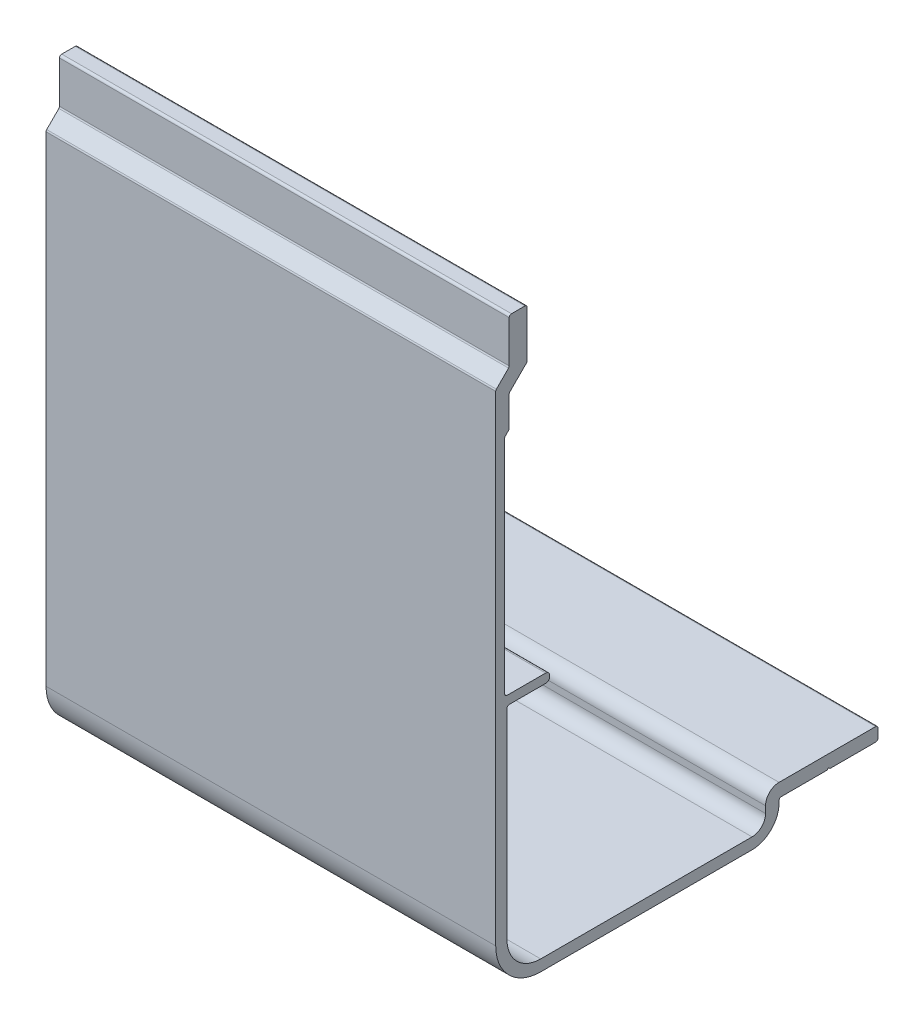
ISO-10303-21;
HEADER;
FILE_DESCRIPTION(('STEP AP214'),'2;1');
FILE_NAME('part.step','',(''),(''),'','','');
FILE_SCHEMA(('AUTOMOTIVE_DESIGN { 1 0 10303 214 1 1 1 1 }'));
ENDSEC;
DATA;
#1=APPLICATION_CONTEXT('core data for automotive mechanical design processes');
#2=APPLICATION_PROTOCOL_DEFINITION('international standard','automotive_design',2000,#1);
#3=PRODUCT_CONTEXT('',#1,'mechanical');
#4=PRODUCT('Part','Part','',(#3));
#5=PRODUCT_RELATED_PRODUCT_CATEGORY('part','',(#4));
#6=PRODUCT_DEFINITION_FORMATION('','',#4);
#7=PRODUCT_DEFINITION_CONTEXT('part definition',#1,'design');
#8=PRODUCT_DEFINITION('design','',#6,#7);
#9=PRODUCT_DEFINITION_SHAPE('','',#8);
#10=(LENGTH_UNIT() NAMED_UNIT(*) SI_UNIT(.MILLI.,.METRE.));
#11=(NAMED_UNIT(*) PLANE_ANGLE_UNIT() SI_UNIT($,.RADIAN.));
#12=(NAMED_UNIT(*) SI_UNIT($,.STERADIAN.) SOLID_ANGLE_UNIT());
#13=UNCERTAINTY_MEASURE_WITH_UNIT(LENGTH_MEASURE(1.E-05),#10,'distance_accuracy_value','');
#14=(GEOMETRIC_REPRESENTATION_CONTEXT(3) GLOBAL_UNCERTAINTY_ASSIGNED_CONTEXT((#13)) GLOBAL_UNIT_ASSIGNED_CONTEXT((#10,
#11,#12)) REPRESENTATION_CONTEXT('',''));
#15=CARTESIAN_POINT('',(0.,0.,0.));
#16=DIRECTION('',(0.,0.,1.));
#17=DIRECTION('',(1.,0.,0.));
#18=AXIS2_PLACEMENT_3D('',#15,#16,#17);
#19=CARTESIAN_POINT('',(50.,0.294066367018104,2.82193188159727));
#20=DIRECTION('',(-1.,0.,0.));
#21=DIRECTION('',(0.,0.,1.));
#22=AXIS2_PLACEMENT_3D('',#19,#20,#21);
#23=CYLINDRICAL_SURFACE('',#22,10.);
#24=CARTESIAN_POINT('',(-50.,0.294066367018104,2.82193188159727));
#25=DIRECTION('',(1.,0.,0.));
#26=DIRECTION('',(0.,0.,-1.));
#27=AXIS2_PLACEMENT_3D('',#24,#25,#26);
#28=CIRCLE('',#27,10.);
#29=CARTESIAN_POINT('',(-50.,0.294066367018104,12.8219318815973));
#30=VERTEX_POINT('',#29);
#31=CARTESIAN_POINT('',(-50.,-9.7059336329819,2.82193188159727));
#32=VERTEX_POINT('',#31);
#33=EDGE_CURVE('E338',#30,#32,#28,.T.);
#34=ORIENTED_EDGE('',*,*,#33,.T.);
#35=DIRECTION('',(-1.,0.,0.));
#36=VECTOR('',#35,1.);
#37=CARTESIAN_POINT('',(50.,-9.7059336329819,2.82193188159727));
#38=LINE('',#37,#36);
#39=CARTESIAN_POINT('',(50.,-9.7059336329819,2.82193188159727));
#40=VERTEX_POINT('',#39);
#41=EDGE_CURVE('E11',#40,#32,#38,.T.);
#42=ORIENTED_EDGE('',*,*,#41,.F.);
#43=CARTESIAN_POINT('',(50.,0.294066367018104,2.82193188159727));
#44=DIRECTION('',(1.,0.,0.));
#45=DIRECTION('',(0.,0.,-1.));
#46=AXIS2_PLACEMENT_3D('',#43,#44,#45);
#47=CIRCLE('',#46,10.);
#48=CARTESIAN_POINT('',(50.,0.294066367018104,12.8219318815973));
#49=VERTEX_POINT('',#48);
#50=EDGE_CURVE('E422',#49,#40,#47,.T.);
#51=ORIENTED_EDGE('',*,*,#50,.F.);
#52=DIRECTION('',(-1.,0.,0.));
#53=VECTOR('',#52,1.);
#54=CARTESIAN_POINT('',(50.,0.294066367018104,12.8219318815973));
#55=LINE('',#54,#53);
#56=EDGE_CURVE('E334',#49,#30,#55,.T.);
#57=ORIENTED_EDGE('',*,*,#56,.T.);
#58=EDGE_LOOP('',(#34,#42,#51,#57));
#59=FACE_BOUND('',#58,.T.);
#60=ADVANCED_FACE('F32',(#59),#23,.T.);
#61=CARTESIAN_POINT('',(50.,-9.7059336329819,2.82193188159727));
#62=DIRECTION('',(0.,1.,0.));
#63=DIRECTION('',(0.,0.,1.));
#64=AXIS2_PLACEMENT_3D('',#61,#62,#63);
#65=PLANE('',#64);
#66=DIRECTION('',(0.,0.,-1.));
#67=VECTOR('',#66,1.);
#68=CARTESIAN_POINT('',(-50.,-9.7059336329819,2.82193188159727));
#69=LINE('',#68,#67);
#70=CARTESIAN_POINT('',(-50.,-9.7059336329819,-44.1780681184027));
#71=VERTEX_POINT('',#70);
#72=EDGE_CURVE('E341',#32,#71,#69,.T.);
#73=ORIENTED_EDGE('',*,*,#72,.T.);
#74=DIRECTION('',(-1.,0.,0.));
#75=VECTOR('',#74,1.);
#76=CARTESIAN_POINT('',(50.,-9.7059336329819,-44.1780681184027));
#77=LINE('',#76,#75);
#78=CARTESIAN_POINT('',(50.,-9.7059336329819,-44.1780681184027));
#79=VERTEX_POINT('',#78);
#80=EDGE_CURVE('E40',#79,#71,#77,.T.);
#81=ORIENTED_EDGE('',*,*,#80,.F.);
#82=DIRECTION('',(0.,0.,-1.));
#83=VECTOR('',#82,1.);
#84=CARTESIAN_POINT('',(50.,-9.7059336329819,2.82193188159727));
#85=LINE('',#84,#83);
#86=EDGE_CURVE('E196',#40,#79,#85,.T.);
#87=ORIENTED_EDGE('',*,*,#86,.F.);
#88=ORIENTED_EDGE('',*,*,#41,.T.);
#89=EDGE_LOOP('',(#73,#81,#87,#88));
#90=FACE_BOUND('',#89,.T.);
#91=ADVANCED_FACE('F655',(#90),#65,.F.);
#92=CARTESIAN_POINT('',(50.,-3.7059336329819,-44.1780681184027));
#93=DIRECTION('',(-1.,0.,0.));
#94=DIRECTION('',(0.,0.,1.));
#95=AXIS2_PLACEMENT_3D('',#92,#93,#94);
#96=CYLINDRICAL_SURFACE('',#95,6.);
#97=CARTESIAN_POINT('',(-50.,-3.7059336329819,-44.1780681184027));
#98=DIRECTION('',(1.,0.,0.));
#99=DIRECTION('',(0.,0.,-1.));
#100=AXIS2_PLACEMENT_3D('',#97,#98,#99);
#101=CIRCLE('',#100,6.);
#102=CARTESIAN_POINT('',(-50.,-3.7059336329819,-50.1780681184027));
#103=VERTEX_POINT('',#102);
#104=EDGE_CURVE('E343',#71,#103,#101,.T.);
#105=ORIENTED_EDGE('',*,*,#104,.T.);
#106=DIRECTION('',(-1.,0.,0.));
#107=VECTOR('',#106,1.);
#108=CARTESIAN_POINT('',(50.,-3.7059336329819,-50.1780681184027));
#109=LINE('',#108,#107);
#110=CARTESIAN_POINT('',(50.,-3.7059336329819,-50.1780681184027));
#111=VERTEX_POINT('',#110);
#112=EDGE_CURVE('E534',#111,#103,#109,.T.);
#113=ORIENTED_EDGE('',*,*,#112,.F.);
#114=CARTESIAN_POINT('',(50.,-3.7059336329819,-44.1780681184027));
#115=DIRECTION('',(1.,0.,0.));
#116=DIRECTION('',(0.,0.,-1.));
#117=AXIS2_PLACEMENT_3D('',#114,#115,#116);
#118=CIRCLE('',#117,6.);
#119=EDGE_CURVE('E542',#79,#111,#118,.T.);
#120=ORIENTED_EDGE('',*,*,#119,.F.);
#121=ORIENTED_EDGE('',*,*,#80,.T.);
#122=EDGE_LOOP('',(#105,#113,#120,#121));
#123=FACE_BOUND('',#122,.T.);
#124=ADVANCED_FACE('F540',(#123),#96,.T.);
#125=CARTESIAN_POINT('',(50.,-3.7059336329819,-50.1780681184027));
#126=DIRECTION('',(0.,0.,1.));
#127=DIRECTION('',(1.,0.,0.));
#128=AXIS2_PLACEMENT_3D('',#125,#126,#127);
#129=PLANE('',#128);
#130=DIRECTION('',(0.,1.,0.));
#131=VECTOR('',#130,1.);
#132=CARTESIAN_POINT('',(-50.,-3.7059336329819,-50.1780681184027));
#133=LINE('',#132,#131);
#134=CARTESIAN_POINT('',(-50.,-3.2059336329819,-50.1780681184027));
#135=VERTEX_POINT('',#134);
#136=EDGE_CURVE('E345',#103,#135,#133,.T.);
#137=ORIENTED_EDGE('',*,*,#136,.T.);
#138=DIRECTION('',(-1.,0.,0.));
#139=VECTOR('',#138,1.);
#140=CARTESIAN_POINT('',(50.,-3.2059336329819,-50.1780681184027));
#141=LINE('',#140,#139);
#142=CARTESIAN_POINT('',(50.,-3.2059336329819,-50.1780681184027));
#143=VERTEX_POINT('',#142);
#144=EDGE_CURVE('E531',#143,#135,#141,.T.);
#145=ORIENTED_EDGE('',*,*,#144,.F.);
#146=DIRECTION('',(0.,1.,0.));
#147=VECTOR('',#146,1.);
#148=CARTESIAN_POINT('',(50.,-3.7059336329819,-50.1780681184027));
#149=LINE('',#148,#147);
#150=EDGE_CURVE('E560',#111,#143,#149,.T.);
#151=ORIENTED_EDGE('',*,*,#150,.F.);
#152=ORIENTED_EDGE('',*,*,#112,.T.);
#153=EDGE_LOOP('',(#137,#145,#151,#152));
#154=FACE_BOUND('',#153,.T.);
#155=ADVANCED_FACE('F551',(#154),#129,.F.);
#156=CARTESIAN_POINT('',(50.,-3.2059336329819,-50.6780681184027));
#157=DIRECTION('',(-1.,0.,0.));
#158=DIRECTION('',(0.,0.,1.));
#159=AXIS2_PLACEMENT_3D('',#156,#157,#158);
#160=CYLINDRICAL_SURFACE('',#159,0.500000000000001);
#161=CARTESIAN_POINT('',(-50.,-3.2059336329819,-50.6780681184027));
#162=DIRECTION('',(-1.,0.,0.));
#163=DIRECTION('',(0.,0.,-1.));
#164=AXIS2_PLACEMENT_3D('',#161,#162,#163);
#165=CIRCLE('',#164,0.500000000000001);
#166=CARTESIAN_POINT('',(-50.,-2.7059336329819,-50.6780681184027));
#167=VERTEX_POINT('',#166);
#168=EDGE_CURVE('E347',#135,#167,#165,.T.);
#169=ORIENTED_EDGE('',*,*,#168,.T.);
#170=DIRECTION('',(-1.,0.,0.));
#171=VECTOR('',#170,1.);
#172=CARTESIAN_POINT('',(50.,-2.7059336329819,-50.6780681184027));
#173=LINE('',#172,#171);
#174=CARTESIAN_POINT('',(50.,-2.7059336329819,-50.6780681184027));
#175=VERTEX_POINT('',#174);
#176=EDGE_CURVE('E528',#175,#167,#173,.T.);
#177=ORIENTED_EDGE('',*,*,#176,.F.);
#178=CARTESIAN_POINT('',(50.,-3.2059336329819,-50.6780681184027));
#179=DIRECTION('',(-1.,0.,0.));
#180=DIRECTION('',(0.,0.,-1.));
#181=AXIS2_PLACEMENT_3D('',#178,#179,#180);
#182=CIRCLE('',#181,0.500000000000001);
#183=EDGE_CURVE('E557',#143,#175,#182,.T.);
#184=ORIENTED_EDGE('',*,*,#183,.F.);
#185=ORIENTED_EDGE('',*,*,#144,.T.);
#186=EDGE_LOOP('',(#169,#177,#184,#185));
#187=FACE_BOUND('',#186,.T.);
#188=ADVANCED_FACE('F555',(#187),#160,.F.);
#189=CARTESIAN_POINT('',(50.,-2.7059336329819,-60.8780681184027));
#190=DIRECTION('',(0.,1.,0.));
#191=DIRECTION('',(0.,0.,1.));
#192=AXIS2_PLACEMENT_3D('',#189,#190,#191);
#193=PLANE('',#192);
#194=DIRECTION('',(0.,0.,-1.));
#195=VECTOR('',#194,1.);
#196=CARTESIAN_POINT('',(-50.,-2.7059336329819,-60.8780681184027));
#197=LINE('',#196,#195);
#198=CARTESIAN_POINT('',(-50.,-2.7059336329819,-60.8780681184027));
#199=VERTEX_POINT('',#198);
#200=EDGE_CURVE('E349',#167,#199,#197,.T.);
#201=ORIENTED_EDGE('',*,*,#200,.T.);
#202=DIRECTION('',(-1.,0.,0.));
#203=VECTOR('',#202,1.);
#204=CARTESIAN_POINT('',(50.,-2.7059336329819,-60.8780681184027));
#205=LINE('',#204,#203);
#206=CARTESIAN_POINT('',(50.,-2.7059336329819,-60.8780681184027));
#207=VERTEX_POINT('',#206);
#208=EDGE_CURVE('E525',#207,#199,#205,.T.);
#209=ORIENTED_EDGE('',*,*,#208,.F.);
#210=DIRECTION('',(0.,0.,-1.));
#211=VECTOR('',#210,1.);
#212=CARTESIAN_POINT('',(50.,-2.7059336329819,-60.8780681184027));
#213=LINE('',#212,#211);
#214=EDGE_CURVE('E559',#175,#207,#213,.T.);
#215=ORIENTED_EDGE('',*,*,#214,.F.);
#216=ORIENTED_EDGE('',*,*,#176,.T.);
#217=EDGE_LOOP('',(#201,#209,#215,#216));
#218=FACE_BOUND('',#217,.T.);
#219=ADVANCED_FACE('F668',(#218),#193,.F.);
#220=CARTESIAN_POINT('',(50.,-2.7059336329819,-60.8780681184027));
#221=DIRECTION('',(0.,0.707106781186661,0.707106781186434));
#222=DIRECTION('',(0.,-0.707106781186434,0.707106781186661));
#223=AXIS2_PLACEMENT_3D('',#220,#221,#222);
#224=PLANE('',#223);
#225=DIRECTION('',(0.,0.707106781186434,-0.707106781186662));
#226=VECTOR('',#225,1.);
#227=CARTESIAN_POINT('',(-50.,-2.7059336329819,-60.8780681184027));
#228=LINE('',#227,#226);
#229=CARTESIAN_POINT('',(-50.,-2.40593363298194,-61.1780681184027));
#230=VERTEX_POINT('',#229);
#231=EDGE_CURVE('E351',#199,#230,#228,.T.);
#232=ORIENTED_EDGE('',*,*,#231,.T.);
#233=DIRECTION('',(-1.,0.,0.));
#234=VECTOR('',#233,1.);
#235=CARTESIAN_POINT('',(50.,-2.40593363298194,-61.1780681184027));
#236=LINE('',#235,#234);
#237=CARTESIAN_POINT('',(50.,-2.40593363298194,-61.1780681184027));
#238=VERTEX_POINT('',#237);
#239=EDGE_CURVE('E522',#238,#230,#236,.T.);
#240=ORIENTED_EDGE('',*,*,#239,.F.);
#241=DIRECTION('',(0.,0.707106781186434,-0.707106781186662));
#242=VECTOR('',#241,1.);
#243=CARTESIAN_POINT('',(50.,-2.7059336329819,-60.8780681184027));
#244=LINE('',#243,#242);
#245=EDGE_CURVE('E562',#207,#238,#244,.T.);
#246=ORIENTED_EDGE('',*,*,#245,.F.);
#247=ORIENTED_EDGE('',*,*,#208,.T.);
#248=EDGE_LOOP('',(#232,#240,#246,#247));
#249=FACE_BOUND('',#248,.T.);
#250=ADVANCED_FACE('F671',(#249),#224,.F.);
#251=CARTESIAN_POINT('',(50.,-2.40593363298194,-61.1780681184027));
#252=DIRECTION('',(0.,0.707106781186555,-0.70710678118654));
#253=DIRECTION('',(0.,0.70710678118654,0.707106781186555));
#254=AXIS2_PLACEMENT_3D('',#251,#252,#253);
#255=PLANE('',#254);
#256=DIRECTION('',(0.,-0.70710678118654,-0.707106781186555));
#257=VECTOR('',#256,1.);
#258=CARTESIAN_POINT('',(-50.,-2.40593363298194,-61.1780681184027));
#259=LINE('',#258,#257);
#260=CARTESIAN_POINT('',(-50.,-2.7059336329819,-61.4780681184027));
#261=VERTEX_POINT('',#260);
#262=EDGE_CURVE('E353',#230,#261,#259,.T.);
#263=ORIENTED_EDGE('',*,*,#262,.T.);
#264=DIRECTION('',(-1.,0.,0.));
#265=VECTOR('',#264,1.);
#266=CARTESIAN_POINT('',(50.,-2.7059336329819,-61.4780681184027));
#267=LINE('',#266,#265);
#268=CARTESIAN_POINT('',(50.,-2.7059336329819,-61.4780681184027));
#269=VERTEX_POINT('',#268);
#270=EDGE_CURVE('E519',#269,#261,#267,.T.);
#271=ORIENTED_EDGE('',*,*,#270,.F.);
#272=DIRECTION('',(0.,-0.70710678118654,-0.707106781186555));
#273=VECTOR('',#272,1.);
#274=CARTESIAN_POINT('',(50.,-2.40593363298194,-61.1780681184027));
#275=LINE('',#274,#273);
#276=EDGE_CURVE('E568',#238,#269,#275,.T.);
#277=ORIENTED_EDGE('',*,*,#276,.F.);
#278=ORIENTED_EDGE('',*,*,#239,.T.);
#279=EDGE_LOOP('',(#263,#271,#277,#278));
#280=FACE_BOUND('',#279,.T.);
#281=ADVANCED_FACE('F675',(#280),#255,.F.);
#282=CARTESIAN_POINT('',(50.,-2.7059336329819,-61.4780681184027));
#283=DIRECTION('',(0.,1.,0.));
#284=DIRECTION('',(0.,0.,1.));
#285=AXIS2_PLACEMENT_3D('',#282,#283,#284);
#286=PLANE('',#285);
#287=DIRECTION('',(0.,0.,-1.));
#288=VECTOR('',#287,1.);
#289=CARTESIAN_POINT('',(-50.,-2.7059336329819,-61.4780681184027));
#290=LINE('',#289,#288);
#291=CARTESIAN_POINT('',(-50.,-2.7059336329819,-71.6780681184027));
#292=VERTEX_POINT('',#291);
#293=EDGE_CURVE('E355',#261,#292,#290,.T.);
#294=ORIENTED_EDGE('',*,*,#293,.T.);
#295=DIRECTION('',(-1.,0.,0.));
#296=VECTOR('',#295,1.);
#297=CARTESIAN_POINT('',(50.,-2.7059336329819,-71.6780681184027));
#298=LINE('',#297,#296);
#299=CARTESIAN_POINT('',(50.,-2.7059336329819,-71.6780681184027));
#300=VERTEX_POINT('',#299);
#301=EDGE_CURVE('E516',#300,#292,#298,.T.);
#302=ORIENTED_EDGE('',*,*,#301,.F.);
#303=DIRECTION('',(0.,0.,-1.));
#304=VECTOR('',#303,1.);
#305=CARTESIAN_POINT('',(50.,-2.7059336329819,-61.4780681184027));
#306=LINE('',#305,#304);
#307=EDGE_CURVE('E570',#269,#300,#306,.T.);
#308=ORIENTED_EDGE('',*,*,#307,.F.);
#309=ORIENTED_EDGE('',*,*,#270,.T.);
#310=EDGE_LOOP('',(#294,#302,#308,#309));
#311=FACE_BOUND('',#310,.T.);
#312=ADVANCED_FACE('F679',(#311),#286,.F.);
#313=CARTESIAN_POINT('',(50.,-2.2059336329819,-71.6780681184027));
#314=DIRECTION('',(-1.,0.,0.));
#315=DIRECTION('',(0.,0.,1.));
#316=AXIS2_PLACEMENT_3D('',#313,#314,#315);
#317=CYLINDRICAL_SURFACE('',#316,0.5);
#318=CARTESIAN_POINT('',(-50.,-2.2059336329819,-71.6780681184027));
#319=DIRECTION('',(1.,0.,0.));
#320=DIRECTION('',(0.,0.,-1.));
#321=AXIS2_PLACEMENT_3D('',#318,#319,#320);
#322=CIRCLE('',#321,0.5);
#323=CARTESIAN_POINT('',(-50.,-2.2059336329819,-72.1780681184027));
#324=VERTEX_POINT('',#323);
#325=EDGE_CURVE('E357',#292,#324,#322,.T.);
#326=ORIENTED_EDGE('',*,*,#325,.T.);
#327=DIRECTION('',(-1.,0.,0.));
#328=VECTOR('',#327,1.);
#329=CARTESIAN_POINT('',(50.,-2.2059336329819,-72.1780681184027));
#330=LINE('',#329,#328);
#331=CARTESIAN_POINT('',(50.,-2.2059336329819,-72.1780681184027));
#332=VERTEX_POINT('',#331);
#333=EDGE_CURVE('E513',#332,#324,#330,.T.);
#334=ORIENTED_EDGE('',*,*,#333,.F.);
#335=CARTESIAN_POINT('',(50.,-2.2059336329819,-71.6780681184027));
#336=DIRECTION('',(1.,0.,0.));
#337=DIRECTION('',(0.,0.,-1.));
#338=AXIS2_PLACEMENT_3D('',#335,#336,#337);
#339=CIRCLE('',#338,0.5);
#340=EDGE_CURVE('E572',#300,#332,#339,.T.);
#341=ORIENTED_EDGE('',*,*,#340,.F.);
#342=ORIENTED_EDGE('',*,*,#301,.T.);
#343=EDGE_LOOP('',(#326,#334,#341,#342));
#344=FACE_BOUND('',#343,.T.);
#345=ADVANCED_FACE('F683',(#344),#317,.T.);
#346=CARTESIAN_POINT('',(50.,-2.2059336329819,-72.1780681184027));
#347=DIRECTION('',(0.,0.,1.));
#348=DIRECTION('',(1.,0.,0.));
#349=AXIS2_PLACEMENT_3D('',#346,#347,#348);
#350=PLANE('',#349);
#351=DIRECTION('',(0.,1.,0.));
#352=VECTOR('',#351,1.);
#353=CARTESIAN_POINT('',(-50.,-2.2059336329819,-72.1780681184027));
#354=LINE('',#353,#352);
#355=CARTESIAN_POINT('',(-50.,-0.205933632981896,-72.1780681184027));
#356=VERTEX_POINT('',#355);
#357=EDGE_CURVE('E359',#324,#356,#354,.T.);
#358=ORIENTED_EDGE('',*,*,#357,.T.);
#359=DIRECTION('',(-1.,0.,0.));
#360=VECTOR('',#359,1.);
#361=CARTESIAN_POINT('',(50.,-0.205933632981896,-72.1780681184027));
#362=LINE('',#361,#360);
#363=CARTESIAN_POINT('',(50.,-0.205933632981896,-72.1780681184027));
#364=VERTEX_POINT('',#363);
#365=EDGE_CURVE('E510',#364,#356,#362,.T.);
#366=ORIENTED_EDGE('',*,*,#365,.F.);
#367=DIRECTION('',(0.,1.,0.));
#368=VECTOR('',#367,1.);
#369=CARTESIAN_POINT('',(50.,-2.2059336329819,-72.1780681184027));
#370=LINE('',#369,#368);
#371=EDGE_CURVE('E574',#332,#364,#370,.T.);
#372=ORIENTED_EDGE('',*,*,#371,.F.);
#373=ORIENTED_EDGE('',*,*,#333,.T.);
#374=EDGE_LOOP('',(#358,#366,#372,#373));
#375=FACE_BOUND('',#374,.T.);
#376=ADVANCED_FACE('F687',(#375),#350,.F.);
#377=CARTESIAN_POINT('',(50.,-0.205933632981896,-71.6780681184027));
#378=DIRECTION('',(-1.,0.,0.));
#379=DIRECTION('',(0.,0.,1.));
#380=AXIS2_PLACEMENT_3D('',#377,#378,#379);
#381=CYLINDRICAL_SURFACE('',#380,0.5);
#382=CARTESIAN_POINT('',(-50.,-0.205933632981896,-71.6780681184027));
#383=DIRECTION('',(1.,0.,0.));
#384=DIRECTION('',(0.,0.,-1.));
#385=AXIS2_PLACEMENT_3D('',#382,#383,#384);
#386=CIRCLE('',#385,0.5);
#387=CARTESIAN_POINT('',(-50.,0.294066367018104,-71.6780681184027));
#388=VERTEX_POINT('',#387);
#389=EDGE_CURVE('E361',#356,#388,#386,.T.);
#390=ORIENTED_EDGE('',*,*,#389,.T.);
#391=DIRECTION('',(-1.,0.,0.));
#392=VECTOR('',#391,1.);
#393=CARTESIAN_POINT('',(50.,0.294066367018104,-71.6780681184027));
#394=LINE('',#393,#392);
#395=CARTESIAN_POINT('',(50.,0.294066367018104,-71.6780681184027));
#396=VERTEX_POINT('',#395);
#397=EDGE_CURVE('E507',#396,#388,#394,.T.);
#398=ORIENTED_EDGE('',*,*,#397,.F.);
#399=CARTESIAN_POINT('',(50.,-0.205933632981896,-71.6780681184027));
#400=DIRECTION('',(1.,0.,0.));
#401=DIRECTION('',(0.,0.,-1.));
#402=AXIS2_PLACEMENT_3D('',#399,#400,#401);
#403=CIRCLE('',#402,0.5);
#404=EDGE_CURVE('E576',#364,#396,#403,.T.);
#405=ORIENTED_EDGE('',*,*,#404,.F.);
#406=ORIENTED_EDGE('',*,*,#365,.T.);
#407=EDGE_LOOP('',(#390,#398,#405,#406));
#408=FACE_BOUND('',#407,.T.);
#409=ADVANCED_FACE('F691',(#408),#381,.T.);
#410=CARTESIAN_POINT('',(50.,0.294066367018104,-71.6780681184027));
#411=DIRECTION('',(0.,-1.,0.));
#412=DIRECTION('',(0.,0.,-1.));
#413=AXIS2_PLACEMENT_3D('',#410,#411,#412);
#414=PLANE('',#413);
#415=DIRECTION('',(0.,0.,1.));
#416=VECTOR('',#415,1.);
#417=CARTESIAN_POINT('',(-50.,0.294066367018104,-71.6780681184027));
#418=LINE('',#417,#416);
#419=CARTESIAN_POINT('',(-50.,0.294066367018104,-50.1780681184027));
#420=VERTEX_POINT('',#419);
#421=EDGE_CURVE('E363',#388,#420,#418,.T.);
#422=ORIENTED_EDGE('',*,*,#421,.T.);
#423=DIRECTION('',(-1.,0.,0.));
#424=VECTOR('',#423,1.);
#425=CARTESIAN_POINT('',(50.,0.294066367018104,-50.1780681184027));
#426=LINE('',#425,#424);
#427=CARTESIAN_POINT('',(50.,0.294066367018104,-50.1780681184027));
#428=VERTEX_POINT('',#427);
#429=EDGE_CURVE('E504',#428,#420,#426,.T.);
#430=ORIENTED_EDGE('',*,*,#429,.F.);
#431=DIRECTION('',(0.,0.,1.));
#432=VECTOR('',#431,1.);
#433=CARTESIAN_POINT('',(50.,0.294066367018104,-71.6780681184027));
#434=LINE('',#433,#432);
#435=EDGE_CURVE('E578',#396,#428,#434,.T.);
#436=ORIENTED_EDGE('',*,*,#435,.F.);
#437=ORIENTED_EDGE('',*,*,#397,.T.);
#438=EDGE_LOOP('',(#422,#430,#436,#437));
#439=FACE_BOUND('',#438,.T.);
#440=ADVANCED_FACE('F695',(#439),#414,.F.);
#441=CARTESIAN_POINT('',(50.,-2.7059336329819,-50.1780681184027));
#442=DIRECTION('',(-1.,0.,0.));
#443=DIRECTION('',(0.,0.,1.));
#444=AXIS2_PLACEMENT_3D('',#441,#442,#443);
#445=CYLINDRICAL_SURFACE('',#444,3.);
#446=CARTESIAN_POINT('',(-50.,-2.7059336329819,-50.1780681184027));
#447=DIRECTION('',(1.,0.,0.));
#448=DIRECTION('',(0.,0.,-1.));
#449=AXIS2_PLACEMENT_3D('',#446,#447,#448);
#450=CIRCLE('',#449,3.);
#451=CARTESIAN_POINT('',(-50.,-2.7059336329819,-47.1780681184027));
#452=VERTEX_POINT('',#451);
#453=EDGE_CURVE('E365',#420,#452,#450,.T.);
#454=ORIENTED_EDGE('',*,*,#453,.T.);
#455=DIRECTION('',(-1.,0.,0.));
#456=VECTOR('',#455,1.);
#457=CARTESIAN_POINT('',(50.,-2.7059336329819,-47.1780681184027));
#458=LINE('',#457,#456);
#459=CARTESIAN_POINT('',(50.,-2.7059336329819,-47.1780681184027));
#460=VERTEX_POINT('',#459);
#461=EDGE_CURVE('E501',#460,#452,#458,.T.);
#462=ORIENTED_EDGE('',*,*,#461,.F.);
#463=CARTESIAN_POINT('',(50.,-2.7059336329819,-50.1780681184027));
#464=DIRECTION('',(1.,0.,0.));
#465=DIRECTION('',(0.,0.,-1.));
#466=AXIS2_PLACEMENT_3D('',#463,#464,#465);
#467=CIRCLE('',#466,3.);
#468=EDGE_CURVE('E580',#428,#460,#467,.T.);
#469=ORIENTED_EDGE('',*,*,#468,.F.);
#470=ORIENTED_EDGE('',*,*,#429,.T.);
#471=EDGE_LOOP('',(#454,#462,#469,#470));
#472=FACE_BOUND('',#471,.T.);
#473=ADVANCED_FACE('F699',(#472),#445,.T.);
#474=CARTESIAN_POINT('',(50.,-2.7059336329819,-47.1780681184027));
#475=DIRECTION('',(0.,0.,-1.));
#476=DIRECTION('',(-1.,0.,0.));
#477=AXIS2_PLACEMENT_3D('',#474,#475,#476);
#478=PLANE('',#477);
#479=DIRECTION('',(0.,-1.,0.));
#480=VECTOR('',#479,1.);
#481=CARTESIAN_POINT('',(-50.,-2.7059336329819,-47.1780681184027));
#482=LINE('',#481,#480);
#483=CARTESIAN_POINT('',(-50.,-4.2059336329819,-47.1780681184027));
#484=VERTEX_POINT('',#483);
#485=EDGE_CURVE('E367',#452,#484,#482,.T.);
#486=ORIENTED_EDGE('',*,*,#485,.T.);
#487=DIRECTION('',(-1.,0.,0.));
#488=VECTOR('',#487,1.);
#489=CARTESIAN_POINT('',(50.,-4.2059336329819,-47.1780681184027));
#490=LINE('',#489,#488);
#491=CARTESIAN_POINT('',(50.,-4.2059336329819,-47.1780681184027));
#492=VERTEX_POINT('',#491);
#493=EDGE_CURVE('E498',#492,#484,#490,.T.);
#494=ORIENTED_EDGE('',*,*,#493,.F.);
#495=DIRECTION('',(0.,-1.,0.));
#496=VECTOR('',#495,1.);
#497=CARTESIAN_POINT('',(50.,-2.7059336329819,-47.1780681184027));
#498=LINE('',#497,#496);
#499=EDGE_CURVE('E582',#460,#492,#498,.T.);
#500=ORIENTED_EDGE('',*,*,#499,.F.);
#501=ORIENTED_EDGE('',*,*,#461,.T.);
#502=EDGE_LOOP('',(#486,#494,#500,#501));
#503=FACE_BOUND('',#502,.T.);
#504=ADVANCED_FACE('F703',(#503),#478,.F.);
#505=CARTESIAN_POINT('',(50.,-4.2059336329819,-44.1780681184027));
#506=DIRECTION('',(-1.,0.,0.));
#507=DIRECTION('',(0.,0.,1.));
#508=AXIS2_PLACEMENT_3D('',#505,#506,#507);
#509=CYLINDRICAL_SURFACE('',#508,3.);
#510=CARTESIAN_POINT('',(-50.,-4.2059336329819,-44.1780681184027));
#511=DIRECTION('',(-1.,0.,0.));
#512=DIRECTION('',(0.,0.,-1.));
#513=AXIS2_PLACEMENT_3D('',#510,#511,#512);
#514=CIRCLE('',#513,3.);
#515=CARTESIAN_POINT('',(-50.,-7.2059336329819,-44.1780681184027));
#516=VERTEX_POINT('',#515);
#517=EDGE_CURVE('E369',#484,#516,#514,.T.);
#518=ORIENTED_EDGE('',*,*,#517,.T.);
#519=DIRECTION('',(-1.,0.,0.));
#520=VECTOR('',#519,1.);
#521=CARTESIAN_POINT('',(50.,-7.2059336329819,-44.1780681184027));
#522=LINE('',#521,#520);
#523=CARTESIAN_POINT('',(50.,-7.2059336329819,-44.1780681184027));
#524=VERTEX_POINT('',#523);
#525=EDGE_CURVE('E495',#524,#516,#522,.T.);
#526=ORIENTED_EDGE('',*,*,#525,.F.);
#527=CARTESIAN_POINT('',(50.,-4.2059336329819,-44.1780681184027));
#528=DIRECTION('',(-1.,0.,0.));
#529=DIRECTION('',(0.,0.,-1.));
#530=AXIS2_PLACEMENT_3D('',#527,#528,#529);
#531=CIRCLE('',#530,3.);
#532=EDGE_CURVE('E584',#492,#524,#531,.T.);
#533=ORIENTED_EDGE('',*,*,#532,.F.);
#534=ORIENTED_EDGE('',*,*,#493,.T.);
#535=EDGE_LOOP('',(#518,#526,#533,#534));
#536=FACE_BOUND('',#535,.T.);
#537=ADVANCED_FACE('F707',(#536),#509,.F.);
#538=CARTESIAN_POINT('',(50.,-7.2059336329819,-44.1780681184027));
#539=DIRECTION('',(0.,-1.,0.));
#540=DIRECTION('',(0.,0.,-1.));
#541=AXIS2_PLACEMENT_3D('',#538,#539,#540);
#542=PLANE('',#541);
#543=DIRECTION('',(0.,0.,1.));
#544=VECTOR('',#543,1.);
#545=CARTESIAN_POINT('',(-50.,-7.2059336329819,-44.1780681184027));
#546=LINE('',#545,#544);
#547=CARTESIAN_POINT('',(-50.,-7.2059336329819,2.82193188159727));
#548=VERTEX_POINT('',#547);
#549=EDGE_CURVE('E371',#516,#548,#546,.T.);
#550=ORIENTED_EDGE('',*,*,#549,.T.);
#551=DIRECTION('',(-1.,0.,0.));
#552=VECTOR('',#551,1.);
#553=CARTESIAN_POINT('',(50.,-7.2059336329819,2.82193188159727));
#554=LINE('',#553,#552);
#555=CARTESIAN_POINT('',(50.,-7.2059336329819,2.82193188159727));
#556=VERTEX_POINT('',#555);
#557=EDGE_CURVE('E492',#556,#548,#554,.T.);
#558=ORIENTED_EDGE('',*,*,#557,.F.);
#559=DIRECTION('',(0.,0.,1.));
#560=VECTOR('',#559,1.);
#561=CARTESIAN_POINT('',(50.,-7.2059336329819,-44.1780681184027));
#562=LINE('',#561,#560);
#563=EDGE_CURVE('E586',#524,#556,#562,.T.);
#564=ORIENTED_EDGE('',*,*,#563,.F.);
#565=ORIENTED_EDGE('',*,*,#525,.T.);
#566=EDGE_LOOP('',(#550,#558,#564,#565));
#567=FACE_BOUND('',#566,.T.);
#568=ADVANCED_FACE('F711',(#567),#542,.F.);
#569=CARTESIAN_POINT('',(50.,0.294066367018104,2.82193188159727));
#570=DIRECTION('',(-1.,0.,0.));
#571=DIRECTION('',(0.,0.,1.));
#572=AXIS2_PLACEMENT_3D('',#569,#570,#571);
#573=CYLINDRICAL_SURFACE('',#572,7.5);
#574=CARTESIAN_POINT('',(-50.,0.294066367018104,2.82193188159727));
#575=DIRECTION('',(-1.,0.,0.));
#576=DIRECTION('',(0.,0.,-1.));
#577=AXIS2_PLACEMENT_3D('',#574,#575,#576);
#578=CIRCLE('',#577,7.5);
#579=CARTESIAN_POINT('',(-50.,0.294066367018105,10.3219318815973));
#580=VERTEX_POINT('',#579);
#581=EDGE_CURVE('E373',#548,#580,#578,.T.);
#582=ORIENTED_EDGE('',*,*,#581,.T.);
#583=DIRECTION('',(-1.,0.,0.));
#584=VECTOR('',#583,1.);
#585=CARTESIAN_POINT('',(50.,0.294066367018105,10.3219318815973));
#586=LINE('',#585,#584);
#587=CARTESIAN_POINT('',(50.,0.294066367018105,10.3219318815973));
#588=VERTEX_POINT('',#587);
#589=EDGE_CURVE('E489',#588,#580,#586,.T.);
#590=ORIENTED_EDGE('',*,*,#589,.F.);
#591=CARTESIAN_POINT('',(50.,0.294066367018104,2.82193188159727));
#592=DIRECTION('',(-1.,0.,0.));
#593=DIRECTION('',(0.,0.,-1.));
#594=AXIS2_PLACEMENT_3D('',#591,#592,#593);
#595=CIRCLE('',#594,7.5);
#596=EDGE_CURVE('E588',#556,#588,#595,.T.);
#597=ORIENTED_EDGE('',*,*,#596,.F.);
#598=ORIENTED_EDGE('',*,*,#557,.T.);
#599=EDGE_LOOP('',(#582,#590,#597,#598));
#600=FACE_BOUND('',#599,.T.);
#601=ADVANCED_FACE('F715',(#600),#573,.F.);
#602=CARTESIAN_POINT('',(50.,0.294066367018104,10.3219318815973));
#603=DIRECTION('',(0.,0.,1.));
#604=DIRECTION('',(1.,0.,0.));
#605=AXIS2_PLACEMENT_3D('',#602,#603,#604);
#606=PLANE('',#605);
#607=DIRECTION('',(0.,1.,0.));
#608=VECTOR('',#607,1.);
#609=CARTESIAN_POINT('',(-50.,0.294066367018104,10.3219318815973));
#610=LINE('',#609,#608);
#611=CARTESIAN_POINT('',(-50.,44.7940663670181,10.3219318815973));
#612=VERTEX_POINT('',#611);
#613=EDGE_CURVE('E375',#580,#612,#610,.T.);
#614=ORIENTED_EDGE('',*,*,#613,.T.);
#615=DIRECTION('',(-1.,0.,0.));
#616=VECTOR('',#615,1.);
#617=CARTESIAN_POINT('',(50.,44.7940663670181,10.3219318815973));
#618=LINE('',#617,#616);
#619=CARTESIAN_POINT('',(50.,44.7940663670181,10.3219318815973));
#620=VERTEX_POINT('',#619);
#621=EDGE_CURVE('E486',#620,#612,#618,.T.);
#622=ORIENTED_EDGE('',*,*,#621,.F.);
#623=DIRECTION('',(0.,1.,0.));
#624=VECTOR('',#623,1.);
#625=CARTESIAN_POINT('',(50.,0.294066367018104,10.3219318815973));
#626=LINE('',#625,#624);
#627=EDGE_CURVE('E590',#588,#620,#626,.T.);
#628=ORIENTED_EDGE('',*,*,#627,.F.);
#629=ORIENTED_EDGE('',*,*,#589,.T.);
#630=EDGE_LOOP('',(#614,#622,#628,#629));
#631=FACE_BOUND('',#630,.T.);
#632=ADVANCED_FACE('F719',(#631),#606,.F.);
#633=CARTESIAN_POINT('',(50.,44.7940663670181,9.82193188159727));
#634=DIRECTION('',(-1.,0.,0.));
#635=DIRECTION('',(0.,0.,1.));
#636=AXIS2_PLACEMENT_3D('',#633,#634,#635);
#637=CYLINDRICAL_SURFACE('',#636,0.500000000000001);
#638=CARTESIAN_POINT('',(-50.,44.7940663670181,9.82193188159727));
#639=DIRECTION('',(-1.,0.,0.));
#640=DIRECTION('',(0.,0.,-1.));
#641=AXIS2_PLACEMENT_3D('',#638,#639,#640);
#642=CIRCLE('',#641,0.500000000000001);
#643=CARTESIAN_POINT('',(-50.,45.2940663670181,9.82193188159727));
#644=VERTEX_POINT('',#643);
#645=EDGE_CURVE('E377',#612,#644,#642,.T.);
#646=ORIENTED_EDGE('',*,*,#645,.T.);
#647=DIRECTION('',(-1.,0.,0.));
#648=VECTOR('',#647,1.);
#649=CARTESIAN_POINT('',(50.,45.2940663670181,9.82193188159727));
#650=LINE('',#649,#648);
#651=CARTESIAN_POINT('',(50.,45.2940663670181,9.82193188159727));
#652=VERTEX_POINT('',#651);
#653=EDGE_CURVE('E483',#652,#644,#650,.T.);
#654=ORIENTED_EDGE('',*,*,#653,.F.);
#655=CARTESIAN_POINT('',(50.,44.7940663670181,9.82193188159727));
#656=DIRECTION('',(-1.,0.,0.));
#657=DIRECTION('',(0.,0.,-1.));
#658=AXIS2_PLACEMENT_3D('',#655,#656,#657);
#659=CIRCLE('',#658,0.500000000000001);
#660=EDGE_CURVE('E592',#620,#652,#659,.T.);
#661=ORIENTED_EDGE('',*,*,#660,.F.);
#662=ORIENTED_EDGE('',*,*,#621,.T.);
#663=EDGE_LOOP('',(#646,#654,#661,#662));
#664=FACE_BOUND('',#663,.T.);
#665=ADVANCED_FACE('F723',(#664),#637,.F.);
#666=CARTESIAN_POINT('',(50.,45.2940663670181,9.82193188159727));
#667=DIRECTION('',(0.,1.,0.));
#668=DIRECTION('',(0.,0.,1.));
#669=AXIS2_PLACEMENT_3D('',#666,#667,#668);
#670=PLANE('',#669);
#671=DIRECTION('',(0.,0.,-1.));
#672=VECTOR('',#671,1.);
#673=CARTESIAN_POINT('',(-50.,45.2940663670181,9.82193188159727));
#674=LINE('',#673,#672);
#675=CARTESIAN_POINT('',(-50.,45.2940663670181,1.72193188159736));
#676=VERTEX_POINT('',#675);
#677=EDGE_CURVE('E379',#644,#676,#674,.T.);
#678=ORIENTED_EDGE('',*,*,#677,.T.);
#679=DIRECTION('',(-1.,0.,0.));
#680=VECTOR('',#679,1.);
#681=CARTESIAN_POINT('',(50.,45.2940663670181,1.72193188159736));
#682=LINE('',#681,#680);
#683=CARTESIAN_POINT('',(50.,45.2940663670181,1.72193188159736));
#684=VERTEX_POINT('',#683);
#685=EDGE_CURVE('E480',#684,#676,#682,.T.);
#686=ORIENTED_EDGE('',*,*,#685,.F.);
#687=DIRECTION('',(0.,0.,-1.));
#688=VECTOR('',#687,1.);
#689=CARTESIAN_POINT('',(50.,45.2940663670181,9.82193188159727));
#690=LINE('',#689,#688);
#691=EDGE_CURVE('E594',#652,#684,#690,.T.);
#692=ORIENTED_EDGE('',*,*,#691,.F.);
#693=ORIENTED_EDGE('',*,*,#653,.T.);
#694=EDGE_LOOP('',(#678,#686,#692,#693));
#695=FACE_BOUND('',#694,.T.);
#696=ADVANCED_FACE('F727',(#695),#670,.F.);
#697=CARTESIAN_POINT('',(50.,46.1940663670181,1.72193188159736));
#698=DIRECTION('',(-1.,0.,0.));
#699=DIRECTION('',(0.,0.,1.));
#700=AXIS2_PLACEMENT_3D('',#697,#698,#699);
#701=CYLINDRICAL_SURFACE('',#700,0.900000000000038);
#702=CARTESIAN_POINT('',(-50.,46.1940663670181,1.72193188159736));
#703=DIRECTION('',(1.,0.,0.));
#704=DIRECTION('',(0.,0.,-1.));
#705=AXIS2_PLACEMENT_3D('',#702,#703,#704);
#706=CIRCLE('',#705,0.900000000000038);
#707=CARTESIAN_POINT('',(-50.,46.1940663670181,0.821931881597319));
#708=VERTEX_POINT('',#707);
#709=EDGE_CURVE('E381',#676,#708,#706,.T.);
#710=ORIENTED_EDGE('',*,*,#709,.T.);
#711=DIRECTION('',(-1.,0.,0.));
#712=VECTOR('',#711,1.);
#713=CARTESIAN_POINT('',(50.,46.1940663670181,0.821931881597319));
#714=LINE('',#713,#712);
#715=CARTESIAN_POINT('',(50.,46.1940663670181,0.821931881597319));
#716=VERTEX_POINT('',#715);
#717=EDGE_CURVE('E477',#716,#708,#714,.T.);
#718=ORIENTED_EDGE('',*,*,#717,.F.);
#719=CARTESIAN_POINT('',(50.,46.1940663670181,1.72193188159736));
#720=DIRECTION('',(1.,0.,0.));
#721=DIRECTION('',(0.,0.,-1.));
#722=AXIS2_PLACEMENT_3D('',#719,#720,#721);
#723=CIRCLE('',#722,0.900000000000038);
#724=EDGE_CURVE('E596',#684,#716,#723,.T.);
#725=ORIENTED_EDGE('',*,*,#724,.F.);
#726=ORIENTED_EDGE('',*,*,#685,.T.);
#727=EDGE_LOOP('',(#710,#718,#725,#726));
#728=FACE_BOUND('',#727,.T.);
#729=ADVANCED_FACE('F731',(#728),#701,.T.);
#730=CARTESIAN_POINT('',(50.,46.1940663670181,0.821931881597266));
#731=DIRECTION('',(0.,0.,1.));
#732=DIRECTION('',(1.,0.,0.));
#733=AXIS2_PLACEMENT_3D('',#730,#731,#732);
#734=PLANE('',#733);
#735=DIRECTION('',(0.,1.,0.));
#736=VECTOR('',#735,1.);
#737=CARTESIAN_POINT('',(-50.,46.1940663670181,0.821931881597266));
#738=LINE('',#737,#736);
#739=CARTESIAN_POINT('',(-50.,46.3940663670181,0.821931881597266));
#740=VERTEX_POINT('',#739);
#741=EDGE_CURVE('E383',#708,#740,#738,.T.);
#742=ORIENTED_EDGE('',*,*,#741,.T.);
#743=DIRECTION('',(-1.,0.,0.));
#744=VECTOR('',#743,1.);
#745=CARTESIAN_POINT('',(50.,46.3940663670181,0.821931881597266));
#746=LINE('',#745,#744);
#747=CARTESIAN_POINT('',(50.,46.3940663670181,0.821931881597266));
#748=VERTEX_POINT('',#747);
#749=EDGE_CURVE('E474',#748,#740,#746,.T.);
#750=ORIENTED_EDGE('',*,*,#749,.F.);
#751=DIRECTION('',(0.,1.,0.));
#752=VECTOR('',#751,1.);
#753=CARTESIAN_POINT('',(50.,46.1940663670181,0.821931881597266));
#754=LINE('',#753,#752);
#755=EDGE_CURVE('E598',#716,#748,#754,.T.);
#756=ORIENTED_EDGE('',*,*,#755,.F.);
#757=ORIENTED_EDGE('',*,*,#717,.T.);
#758=EDGE_LOOP('',(#742,#750,#756,#757));
#759=FACE_BOUND('',#758,.T.);
#760=ADVANCED_FACE('F735',(#759),#734,.F.);
#761=CARTESIAN_POINT('',(50.,46.3940663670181,1.72193188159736));
#762=DIRECTION('',(-1.,0.,0.));
#763=DIRECTION('',(0.,0.,1.));
#764=AXIS2_PLACEMENT_3D('',#761,#762,#763);
#765=CYLINDRICAL_SURFACE('',#764,0.900000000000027);
#766=CARTESIAN_POINT('',(-50.,46.3940663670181,1.72193188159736));
#767=DIRECTION('',(1.,0.,0.));
#768=DIRECTION('',(0.,0.,-1.));
#769=AXIS2_PLACEMENT_3D('',#766,#767,#768);
#770=CIRCLE('',#769,0.900000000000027);
#771=CARTESIAN_POINT('',(-50.,47.2940663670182,1.72193188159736));
#772=VERTEX_POINT('',#771);
#773=EDGE_CURVE('E385',#740,#772,#770,.T.);
#774=ORIENTED_EDGE('',*,*,#773,.T.);
#775=DIRECTION('',(-1.,0.,0.));
#776=VECTOR('',#775,1.);
#777=CARTESIAN_POINT('',(50.,47.2940663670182,1.72193188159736));
#778=LINE('',#777,#776);
#779=CARTESIAN_POINT('',(50.,47.2940663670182,1.72193188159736));
#780=VERTEX_POINT('',#779);
#781=EDGE_CURVE('E471',#780,#772,#778,.T.);
#782=ORIENTED_EDGE('',*,*,#781,.F.);
#783=CARTESIAN_POINT('',(50.,46.3940663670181,1.72193188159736));
#784=DIRECTION('',(1.,0.,0.));
#785=DIRECTION('',(0.,0.,-1.));
#786=AXIS2_PLACEMENT_3D('',#783,#784,#785);
#787=CIRCLE('',#786,0.900000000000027);
#788=EDGE_CURVE('E600',#748,#780,#787,.T.);
#789=ORIENTED_EDGE('',*,*,#788,.F.);
#790=ORIENTED_EDGE('',*,*,#749,.T.);
#791=EDGE_LOOP('',(#774,#782,#789,#790));
#792=FACE_BOUND('',#791,.T.);
#793=ADVANCED_FACE('F739',(#792),#765,.T.);
#794=CARTESIAN_POINT('',(50.,47.2940663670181,1.72193188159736));
#795=DIRECTION('',(0.,-1.,0.));
#796=DIRECTION('',(0.,0.,-1.));
#797=AXIS2_PLACEMENT_3D('',#794,#795,#796);
#798=PLANE('',#797);
#799=DIRECTION('',(0.,0.,1.));
#800=VECTOR('',#799,1.);
#801=CARTESIAN_POINT('',(-50.,47.2940663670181,1.72193188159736));
#802=LINE('',#801,#800);
#803=CARTESIAN_POINT('',(-50.,47.2940663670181,10.3219318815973));
#804=VERTEX_POINT('',#803);
#805=EDGE_CURVE('E387',#772,#804,#802,.T.);
#806=ORIENTED_EDGE('',*,*,#805,.T.);
#807=DIRECTION('',(-1.,0.,0.));
#808=VECTOR('',#807,1.);
#809=CARTESIAN_POINT('',(50.,47.2940663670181,10.3219318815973));
#810=LINE('',#809,#808);
#811=CARTESIAN_POINT('',(50.,47.2940663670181,10.3219318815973));
#812=VERTEX_POINT('',#811);
#813=EDGE_CURVE('E468',#812,#804,#810,.T.);
#814=ORIENTED_EDGE('',*,*,#813,.F.);
#815=DIRECTION('',(0.,0.,1.));
#816=VECTOR('',#815,1.);
#817=CARTESIAN_POINT('',(50.,47.2940663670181,1.72193188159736));
#818=LINE('',#817,#816);
#819=EDGE_CURVE('E602',#780,#812,#818,.T.);
#820=ORIENTED_EDGE('',*,*,#819,.F.);
#821=ORIENTED_EDGE('',*,*,#781,.T.);
#822=EDGE_LOOP('',(#806,#814,#820,#821));
#823=FACE_BOUND('',#822,.T.);
#824=ADVANCED_FACE('F743',(#823),#798,.F.);
#825=CARTESIAN_POINT('',(50.,47.7940663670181,10.3219318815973));
#826=DIRECTION('',(-1.,0.,0.));
#827=DIRECTION('',(0.,0.,1.));
#828=AXIS2_PLACEMENT_3D('',#825,#826,#827);
#829=CYLINDRICAL_SURFACE('',#828,0.5);
#830=CARTESIAN_POINT('',(-50.,47.7940663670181,10.3219318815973));
#831=DIRECTION('',(-1.,0.,0.));
#832=DIRECTION('',(0.,0.,-1.));
#833=AXIS2_PLACEMENT_3D('',#830,#831,#832);
#834=CIRCLE('',#833,0.5);
#835=CARTESIAN_POINT('',(-50.,47.7940663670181,10.8219318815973));
#836=VERTEX_POINT('',#835);
#837=EDGE_CURVE('E389',#804,#836,#834,.T.);
#838=ORIENTED_EDGE('',*,*,#837,.T.);
#839=DIRECTION('',(-1.,0.,0.));
#840=VECTOR('',#839,1.);
#841=CARTESIAN_POINT('',(50.,47.7940663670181,10.8219318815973));
#842=LINE('',#841,#840);
#843=CARTESIAN_POINT('',(50.,47.7940663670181,10.8219318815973));
#844=VERTEX_POINT('',#843);
#845=EDGE_CURVE('E465',#844,#836,#842,.T.);
#846=ORIENTED_EDGE('',*,*,#845,.F.);
#847=CARTESIAN_POINT('',(50.,47.7940663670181,10.3219318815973));
#848=DIRECTION('',(-1.,0.,0.));
#849=DIRECTION('',(0.,0.,-1.));
#850=AXIS2_PLACEMENT_3D('',#847,#848,#849);
#851=CIRCLE('',#850,0.5);
#852=EDGE_CURVE('E604',#812,#844,#851,.T.);
#853=ORIENTED_EDGE('',*,*,#852,.F.);
#854=ORIENTED_EDGE('',*,*,#813,.T.);
#855=EDGE_LOOP('',(#838,#846,#853,#854));
#856=FACE_BOUND('',#855,.T.);
#857=ADVANCED_FACE('F747',(#856),#829,.F.);
#858=CARTESIAN_POINT('',(50.,47.7940663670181,10.8219318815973));
#859=DIRECTION('',(0.,0.,1.));
#860=DIRECTION('',(1.,0.,0.));
#861=AXIS2_PLACEMENT_3D('',#858,#859,#860);
#862=PLANE('',#861);
#863=DIRECTION('',(0.,1.,0.));
#864=VECTOR('',#863,1.);
#865=CARTESIAN_POINT('',(-50.,47.7940663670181,10.8219318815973));
#866=LINE('',#865,#864);
#867=CARTESIAN_POINT('',(-50.,97.0869595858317,10.8219318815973));
#868=VERTEX_POINT('',#867);
#869=EDGE_CURVE('E391',#836,#868,#866,.T.);
#870=ORIENTED_EDGE('',*,*,#869,.T.);
#871=DIRECTION('',(-1.,0.,0.));
#872=VECTOR('',#871,1.);
#873=CARTESIAN_POINT('',(50.,97.0869595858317,10.8219318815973));
#874=LINE('',#873,#872);
#875=CARTESIAN_POINT('',(50.,97.0869595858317,10.8219318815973));
#876=VERTEX_POINT('',#875);
#877=EDGE_CURVE('E462',#876,#868,#874,.T.);
#878=ORIENTED_EDGE('',*,*,#877,.F.);
#879=DIRECTION('',(0.,1.,0.));
#880=VECTOR('',#879,1.);
#881=CARTESIAN_POINT('',(50.,47.7940663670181,10.8219318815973));
#882=LINE('',#881,#880);
#883=EDGE_CURVE('E606',#844,#876,#882,.T.);
#884=ORIENTED_EDGE('',*,*,#883,.F.);
#885=ORIENTED_EDGE('',*,*,#845,.T.);
#886=EDGE_LOOP('',(#870,#878,#884,#885));
#887=FACE_BOUND('',#886,.T.);
#888=ADVANCED_FACE('F751',(#887),#862,.F.);
#889=CARTESIAN_POINT('',(50.,97.0869595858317,10.3219318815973));
#890=DIRECTION('',(-1.,0.,0.));
#891=DIRECTION('',(0.,0.,1.));
#892=AXIS2_PLACEMENT_3D('',#889,#890,#891);
#893=CYLINDRICAL_SURFACE('',#892,0.500000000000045);
#894=CARTESIAN_POINT('',(-50.,97.0869595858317,10.3219318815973));
#895=DIRECTION('',(-1.,0.,0.));
#896=DIRECTION('',(0.,0.,-1.));
#897=AXIS2_PLACEMENT_3D('',#894,#895,#896);
#898=CIRCLE('',#897,0.500000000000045);
#899=CARTESIAN_POINT('',(-50.,97.440512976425,10.6754852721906));
#900=VERTEX_POINT('',#899);
#901=EDGE_CURVE('E393',#868,#900,#898,.T.);
#902=ORIENTED_EDGE('',*,*,#901,.T.);
#903=DIRECTION('',(-1.,0.,0.));
#904=VECTOR('',#903,1.);
#905=CARTESIAN_POINT('',(50.,97.440512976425,10.6754852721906));
#906=LINE('',#905,#904);
#907=CARTESIAN_POINT('',(50.,97.440512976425,10.6754852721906));
#908=VERTEX_POINT('',#907);
#909=EDGE_CURVE('E459',#908,#900,#906,.T.);
#910=ORIENTED_EDGE('',*,*,#909,.F.);
#911=CARTESIAN_POINT('',(50.,97.0869595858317,10.3219318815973));
#912=DIRECTION('',(-1.,0.,0.));
#913=DIRECTION('',(0.,0.,-1.));
#914=AXIS2_PLACEMENT_3D('',#911,#912,#913);
#915=CIRCLE('',#914,0.500000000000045);
#916=EDGE_CURVE('E608',#876,#908,#915,.T.);
#917=ORIENTED_EDGE('',*,*,#916,.F.);
#918=ORIENTED_EDGE('',*,*,#877,.T.);
#919=EDGE_LOOP('',(#902,#910,#917,#918));
#920=FACE_BOUND('',#919,.T.);
#921=ADVANCED_FACE('F755',(#920),#893,.F.);
#922=CARTESIAN_POINT('',(50.,98.1476197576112,9.96837849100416));
#923=DIRECTION('',(0.,0.707106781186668,0.707106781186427));
#924=DIRECTION('',(0.,-0.707106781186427,0.707106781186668));
#925=AXIS2_PLACEMENT_3D('',#922,#923,#924);
#926=PLANE('',#925);
#927=DIRECTION('',(0.,0.707106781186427,-0.707106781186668));
#928=VECTOR('',#927,1.);
#929=CARTESIAN_POINT('',(-50.,98.1476197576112,9.96837849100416));
#930=LINE('',#929,#928);
#931=CARTESIAN_POINT('',(-50.,98.1476197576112,9.96837849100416));
#932=VERTEX_POINT('',#931);
#933=EDGE_CURVE('E395',#900,#932,#930,.T.);
#934=ORIENTED_EDGE('',*,*,#933,.T.);
#935=DIRECTION('',(-1.,0.,0.));
#936=VECTOR('',#935,1.);
#937=CARTESIAN_POINT('',(50.,98.1476197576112,9.96837849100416));
#938=LINE('',#937,#936);
#939=CARTESIAN_POINT('',(50.,98.1476197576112,9.96837849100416));
#940=VERTEX_POINT('',#939);
#941=EDGE_CURVE('E456',#940,#932,#938,.T.);
#942=ORIENTED_EDGE('',*,*,#941,.F.);
#943=DIRECTION('',(0.,0.707106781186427,-0.707106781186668));
#944=VECTOR('',#943,1.);
#945=CARTESIAN_POINT('',(50.,98.1476197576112,9.96837849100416));
#946=LINE('',#945,#944);
#947=EDGE_CURVE('E610',#908,#940,#946,.T.);
#948=ORIENTED_EDGE('',*,*,#947,.F.);
#949=ORIENTED_EDGE('',*,*,#909,.T.);
#950=EDGE_LOOP('',(#934,#942,#948,#949));
#951=FACE_BOUND('',#950,.T.);
#952=ADVANCED_FACE('F759',(#951),#926,.F.);
#953=CARTESIAN_POINT('',(50.,98.5011731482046,10.3219318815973));
#954=DIRECTION('',(-1.,0.,0.));
#955=DIRECTION('',(0.,0.,1.));
#956=AXIS2_PLACEMENT_3D('',#953,#954,#955);
#957=CYLINDRICAL_SURFACE('',#956,0.499999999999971);
#958=CARTESIAN_POINT('',(-50.,98.5011731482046,10.3219318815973));
#959=DIRECTION('',(1.,0.,0.));
#960=DIRECTION('',(0.,0.,-1.));
#961=AXIS2_PLACEMENT_3D('',#958,#959,#960);
#962=CIRCLE('',#961,0.499999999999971);
#963=CARTESIAN_POINT('',(-50.,98.5011731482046,9.8219318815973));
#964=VERTEX_POINT('',#963);
#965=EDGE_CURVE('E397',#932,#964,#962,.T.);
#966=ORIENTED_EDGE('',*,*,#965,.T.);
#967=DIRECTION('',(-1.,0.,0.));
#968=VECTOR('',#967,1.);
#969=CARTESIAN_POINT('',(50.,98.5011731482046,9.8219318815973));
#970=LINE('',#969,#968);
#971=CARTESIAN_POINT('',(50.,98.5011731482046,9.8219318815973));
#972=VERTEX_POINT('',#971);
#973=EDGE_CURVE('E453',#972,#964,#970,.T.);
#974=ORIENTED_EDGE('',*,*,#973,.F.);
#975=CARTESIAN_POINT('',(50.,98.5011731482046,10.3219318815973));
#976=DIRECTION('',(1.,0.,0.));
#977=DIRECTION('',(0.,0.,-1.));
#978=AXIS2_PLACEMENT_3D('',#975,#976,#977);
#979=CIRCLE('',#978,0.499999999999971);
#980=EDGE_CURVE('E612',#940,#972,#979,.T.);
#981=ORIENTED_EDGE('',*,*,#980,.F.);
#982=ORIENTED_EDGE('',*,*,#941,.T.);
#983=EDGE_LOOP('',(#966,#974,#981,#982));
#984=FACE_BOUND('',#983,.T.);
#985=ADVANCED_FACE('F763',(#984),#957,.T.);
#986=CARTESIAN_POINT('',(50.,105.086959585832,9.82193188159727));
#987=DIRECTION('',(0.,0.,1.));
#988=DIRECTION('',(1.,0.,0.));
#989=AXIS2_PLACEMENT_3D('',#986,#987,#988);
#990=PLANE('',#989);
#991=DIRECTION('',(0.,1.,0.));
#992=VECTOR('',#991,1.);
#993=CARTESIAN_POINT('',(-50.,105.086959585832,9.82193188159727));
#994=LINE('',#993,#992);
#995=CARTESIAN_POINT('',(-50.,105.086959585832,9.82193188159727));
#996=VERTEX_POINT('',#995);
#997=EDGE_CURVE('E399',#964,#996,#994,.T.);
#998=ORIENTED_EDGE('',*,*,#997,.T.);
#999=DIRECTION('',(-1.,0.,0.));
#1000=VECTOR('',#999,1.);
#1001=CARTESIAN_POINT('',(50.,105.086959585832,9.82193188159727));
#1002=LINE('',#1001,#1000);
#1003=CARTESIAN_POINT('',(50.,105.086959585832,9.82193188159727));
#1004=VERTEX_POINT('',#1003);
#1005=EDGE_CURVE('E450',#1004,#996,#1002,.T.);
#1006=ORIENTED_EDGE('',*,*,#1005,.F.);
#1007=DIRECTION('',(0.,1.,0.));
#1008=VECTOR('',#1007,1.);
#1009=CARTESIAN_POINT('',(50.,105.086959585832,9.82193188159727));
#1010=LINE('',#1009,#1008);
#1011=EDGE_CURVE('E614',#972,#1004,#1010,.T.);
#1012=ORIENTED_EDGE('',*,*,#1011,.F.);
#1013=ORIENTED_EDGE('',*,*,#973,.T.);
#1014=EDGE_LOOP('',(#998,#1006,#1012,#1013));
#1015=FACE_BOUND('',#1014,.T.);
#1016=ADVANCED_FACE('F767',(#1015),#990,.F.);
#1017=CARTESIAN_POINT('',(50.,105.086959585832,9.32193188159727));
#1018=DIRECTION('',(-1.,0.,0.));
#1019=DIRECTION('',(0.,0.,1.));
#1020=AXIS2_PLACEMENT_3D('',#1017,#1018,#1019);
#1021=CYLINDRICAL_SURFACE('',#1020,0.500000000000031);
#1022=CARTESIAN_POINT('',(-50.,105.086959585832,9.32193188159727));
#1023=DIRECTION('',(-1.,0.,0.));
#1024=DIRECTION('',(0.,0.,-1.));
#1025=AXIS2_PLACEMENT_3D('',#1022,#1023,#1024);
#1026=CIRCLE('',#1025,0.500000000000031);
#1027=CARTESIAN_POINT('',(-50.,105.440512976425,9.67548527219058));
#1028=VERTEX_POINT('',#1027);
#1029=EDGE_CURVE('E401',#996,#1028,#1026,.T.);
#1030=ORIENTED_EDGE('',*,*,#1029,.T.);
#1031=DIRECTION('',(-1.,0.,0.));
#1032=VECTOR('',#1031,1.);
#1033=CARTESIAN_POINT('',(50.,105.440512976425,9.67548527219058));
#1034=LINE('',#1033,#1032);
#1035=CARTESIAN_POINT('',(50.,105.440512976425,9.67548527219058));
#1036=VERTEX_POINT('',#1035);
#1037=EDGE_CURVE('E447',#1036,#1028,#1034,.T.);
#1038=ORIENTED_EDGE('',*,*,#1037,.F.);
#1039=CARTESIAN_POINT('',(50.,105.086959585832,9.32193188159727));
#1040=DIRECTION('',(-1.,0.,0.));
#1041=DIRECTION('',(0.,0.,-1.));
#1042=AXIS2_PLACEMENT_3D('',#1039,#1040,#1041);
#1043=CIRCLE('',#1042,0.500000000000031);
#1044=EDGE_CURVE('E616',#1004,#1036,#1043,.T.);
#1045=ORIENTED_EDGE('',*,*,#1044,.F.);
#1046=ORIENTED_EDGE('',*,*,#1005,.T.);
#1047=EDGE_LOOP('',(#1030,#1038,#1045,#1046));
#1048=FACE_BOUND('',#1047,.T.);
#1049=ADVANCED_FACE('F771',(#1048),#1021,.F.);
#1050=CARTESIAN_POINT('',(50.,109.147619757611,5.96837849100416));
#1051=DIRECTION('',(0.,0.70710678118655,0.707106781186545));
#1052=DIRECTION('',(0.,-0.707106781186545,0.70710678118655));
#1053=AXIS2_PLACEMENT_3D('',#1050,#1051,#1052);
#1054=PLANE('',#1053);
#1055=DIRECTION('',(0.,0.707106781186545,-0.70710678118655));
#1056=VECTOR('',#1055,1.);
#1057=CARTESIAN_POINT('',(-50.,109.147619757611,5.96837849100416));
#1058=LINE('',#1057,#1056);
#1059=CARTESIAN_POINT('',(-50.,109.147619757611,5.96837849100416));
#1060=VERTEX_POINT('',#1059);
#1061=EDGE_CURVE('E403',#1028,#1060,#1058,.T.);
#1062=ORIENTED_EDGE('',*,*,#1061,.T.);
#1063=DIRECTION('',(-1.,0.,0.));
#1064=VECTOR('',#1063,1.);
#1065=CARTESIAN_POINT('',(50.,109.147619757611,5.96837849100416));
#1066=LINE('',#1065,#1064);
#1067=CARTESIAN_POINT('',(50.,109.147619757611,5.96837849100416));
#1068=VERTEX_POINT('',#1067);
#1069=EDGE_CURVE('E444',#1068,#1060,#1066,.T.);
#1070=ORIENTED_EDGE('',*,*,#1069,.F.);
#1071=DIRECTION('',(0.,0.707106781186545,-0.70710678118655));
#1072=VECTOR('',#1071,1.);
#1073=CARTESIAN_POINT('',(50.,109.147619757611,5.96837849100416));
#1074=LINE('',#1073,#1072);
#1075=EDGE_CURVE('E618',#1036,#1068,#1074,.T.);
#1076=ORIENTED_EDGE('',*,*,#1075,.F.);
#1077=ORIENTED_EDGE('',*,*,#1037,.T.);
#1078=EDGE_LOOP('',(#1062,#1070,#1076,#1077));
#1079=FACE_BOUND('',#1078,.T.);
#1080=ADVANCED_FACE('F775',(#1079),#1054,.F.);
#1081=CARTESIAN_POINT('',(50.,109.501173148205,6.32193188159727));
#1082=DIRECTION('',(-1.,0.,0.));
#1083=DIRECTION('',(0.,0.,1.));
#1084=AXIS2_PLACEMENT_3D('',#1081,#1082,#1083);
#1085=CYLINDRICAL_SURFACE('',#1084,0.499999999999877);
#1086=CARTESIAN_POINT('',(-50.,109.501173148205,6.32193188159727));
#1087=DIRECTION('',(1.,0.,0.));
#1088=DIRECTION('',(0.,0.,-1.));
#1089=AXIS2_PLACEMENT_3D('',#1086,#1087,#1088);
#1090=CIRCLE('',#1089,0.499999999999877);
#1091=CARTESIAN_POINT('',(-50.,109.501173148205,5.82193188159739));
#1092=VERTEX_POINT('',#1091);
#1093=EDGE_CURVE('E405',#1060,#1092,#1090,.T.);
#1094=ORIENTED_EDGE('',*,*,#1093,.T.);
#1095=DIRECTION('',(-1.,0.,0.));
#1096=VECTOR('',#1095,1.);
#1097=CARTESIAN_POINT('',(50.,109.501173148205,5.82193188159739));
#1098=LINE('',#1097,#1096);
#1099=CARTESIAN_POINT('',(50.,109.501173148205,5.82193188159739));
#1100=VERTEX_POINT('',#1099);
#1101=EDGE_CURVE('E441',#1100,#1092,#1098,.T.);
#1102=ORIENTED_EDGE('',*,*,#1101,.F.);
#1103=CARTESIAN_POINT('',(50.,109.501173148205,6.32193188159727));
#1104=DIRECTION('',(1.,0.,0.));
#1105=DIRECTION('',(0.,0.,-1.));
#1106=AXIS2_PLACEMENT_3D('',#1103,#1104,#1105);
#1107=CIRCLE('',#1106,0.499999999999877);
#1108=EDGE_CURVE('E620',#1068,#1100,#1107,.T.);
#1109=ORIENTED_EDGE('',*,*,#1108,.F.);
#1110=ORIENTED_EDGE('',*,*,#1069,.T.);
#1111=EDGE_LOOP('',(#1094,#1102,#1109,#1110));
#1112=FACE_BOUND('',#1111,.T.);
#1113=ADVANCED_FACE('F779',(#1112),#1085,.T.);
#1114=CARTESIAN_POINT('',(50.,119.794066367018,5.82193188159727));
#1115=DIRECTION('',(0.,0.,1.));
#1116=DIRECTION('',(1.,0.,0.));
#1117=AXIS2_PLACEMENT_3D('',#1114,#1115,#1116);
#1118=PLANE('',#1117);
#1119=DIRECTION('',(0.,1.,0.));
#1120=VECTOR('',#1119,1.);
#1121=CARTESIAN_POINT('',(-50.,119.794066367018,5.82193188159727));
#1122=LINE('',#1121,#1120);
#1123=CARTESIAN_POINT('',(-50.,119.794066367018,5.82193188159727));
#1124=VERTEX_POINT('',#1123);
#1125=EDGE_CURVE('E407',#1092,#1124,#1122,.T.);
#1126=ORIENTED_EDGE('',*,*,#1125,.T.);
#1127=DIRECTION('',(-1.,0.,0.));
#1128=VECTOR('',#1127,1.);
#1129=CARTESIAN_POINT('',(50.,119.794066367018,5.82193188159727));
#1130=LINE('',#1129,#1128);
#1131=CARTESIAN_POINT('',(50.,119.794066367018,5.82193188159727));
#1132=VERTEX_POINT('',#1131);
#1133=EDGE_CURVE('E438',#1132,#1124,#1130,.T.);
#1134=ORIENTED_EDGE('',*,*,#1133,.F.);
#1135=DIRECTION('',(0.,1.,0.));
#1136=VECTOR('',#1135,1.);
#1137=CARTESIAN_POINT('',(50.,119.794066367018,5.82193188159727));
#1138=LINE('',#1137,#1136);
#1139=EDGE_CURVE('E622',#1100,#1132,#1138,.T.);
#1140=ORIENTED_EDGE('',*,*,#1139,.F.);
#1141=ORIENTED_EDGE('',*,*,#1101,.T.);
#1142=EDGE_LOOP('',(#1126,#1134,#1140,#1141));
#1143=FACE_BOUND('',#1142,.T.);
#1144=ADVANCED_FACE('F783',(#1143),#1118,.F.);
#1145=CARTESIAN_POINT('',(50.,119.794066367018,6.32193188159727));
#1146=DIRECTION('',(-1.,0.,0.));
#1147=DIRECTION('',(0.,0.,1.));
#1148=AXIS2_PLACEMENT_3D('',#1145,#1146,#1147);
#1149=CYLINDRICAL_SURFACE('',#1148,0.5);
#1150=CARTESIAN_POINT('',(-50.,119.794066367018,6.32193188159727));
#1151=DIRECTION('',(1.,0.,0.));
#1152=DIRECTION('',(0.,0.,-1.));
#1153=AXIS2_PLACEMENT_3D('',#1150,#1151,#1152);
#1154=CIRCLE('',#1153,0.5);
#1155=CARTESIAN_POINT('',(-50.,120.294066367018,6.32193188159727));
#1156=VERTEX_POINT('',#1155);
#1157=EDGE_CURVE('E409',#1124,#1156,#1154,.T.);
#1158=ORIENTED_EDGE('',*,*,#1157,.T.);
#1159=DIRECTION('',(-1.,0.,0.));
#1160=VECTOR('',#1159,1.);
#1161=CARTESIAN_POINT('',(50.,120.294066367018,6.32193188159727));
#1162=LINE('',#1161,#1160);
#1163=CARTESIAN_POINT('',(50.,120.294066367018,6.32193188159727));
#1164=VERTEX_POINT('',#1163);
#1165=EDGE_CURVE('E435',#1164,#1156,#1162,.T.);
#1166=ORIENTED_EDGE('',*,*,#1165,.F.);
#1167=CARTESIAN_POINT('',(50.,119.794066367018,6.32193188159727));
#1168=DIRECTION('',(1.,0.,0.));
#1169=DIRECTION('',(0.,0.,-1.));
#1170=AXIS2_PLACEMENT_3D('',#1167,#1168,#1169);
#1171=CIRCLE('',#1170,0.5);
#1172=EDGE_CURVE('E624',#1132,#1164,#1171,.T.);
#1173=ORIENTED_EDGE('',*,*,#1172,.F.);
#1174=ORIENTED_EDGE('',*,*,#1133,.T.);
#1175=EDGE_LOOP('',(#1158,#1166,#1173,#1174));
#1176=FACE_BOUND('',#1175,.T.);
#1177=ADVANCED_FACE('F787',(#1176),#1149,.T.);
#1178=CARTESIAN_POINT('',(50.,120.294066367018,9.32193188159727));
#1179=DIRECTION('',(0.,-1.,0.));
#1180=DIRECTION('',(0.,0.,-1.));
#1181=AXIS2_PLACEMENT_3D('',#1178,#1179,#1180);
#1182=PLANE('',#1181);
#1183=DIRECTION('',(0.,0.,1.));
#1184=VECTOR('',#1183,1.);
#1185=CARTESIAN_POINT('',(-50.,120.294066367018,9.32193188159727));
#1186=LINE('',#1185,#1184);
#1187=CARTESIAN_POINT('',(-50.,120.294066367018,9.32193188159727));
#1188=VERTEX_POINT('',#1187);
#1189=EDGE_CURVE('E411',#1156,#1188,#1186,.T.);
#1190=ORIENTED_EDGE('',*,*,#1189,.T.);
#1191=DIRECTION('',(-1.,0.,0.));
#1192=VECTOR('',#1191,1.);
#1193=CARTESIAN_POINT('',(50.,120.294066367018,9.32193188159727));
#1194=LINE('',#1193,#1192);
#1195=CARTESIAN_POINT('',(50.,120.294066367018,9.32193188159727));
#1196=VERTEX_POINT('',#1195);
#1197=EDGE_CURVE('E432',#1196,#1188,#1194,.T.);
#1198=ORIENTED_EDGE('',*,*,#1197,.F.);
#1199=DIRECTION('',(0.,0.,1.));
#1200=VECTOR('',#1199,1.);
#1201=CARTESIAN_POINT('',(50.,120.294066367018,9.32193188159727));
#1202=LINE('',#1201,#1200);
#1203=EDGE_CURVE('E626',#1164,#1196,#1202,.T.);
#1204=ORIENTED_EDGE('',*,*,#1203,.F.);
#1205=ORIENTED_EDGE('',*,*,#1165,.T.);
#1206=EDGE_LOOP('',(#1190,#1198,#1204,#1205));
#1207=FACE_BOUND('',#1206,.T.);
#1208=ADVANCED_FACE('F791',(#1207),#1182,.F.);
#1209=CARTESIAN_POINT('',(50.,119.794066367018,9.32193188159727));
#1210=DIRECTION('',(-1.,0.,0.));
#1211=DIRECTION('',(0.,0.,1.));
#1212=AXIS2_PLACEMENT_3D('',#1209,#1210,#1211);
#1213=CYLINDRICAL_SURFACE('',#1212,0.5);
#1214=CARTESIAN_POINT('',(-50.,119.794066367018,9.32193188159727));
#1215=DIRECTION('',(1.,0.,0.));
#1216=DIRECTION('',(0.,0.,-1.));
#1217=AXIS2_PLACEMENT_3D('',#1214,#1215,#1216);
#1218=CIRCLE('',#1217,0.5);
#1219=CARTESIAN_POINT('',(-50.,119.794066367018,9.82193188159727));
#1220=VERTEX_POINT('',#1219);
#1221=EDGE_CURVE('E413',#1188,#1220,#1218,.T.);
#1222=ORIENTED_EDGE('',*,*,#1221,.T.);
#1223=DIRECTION('',(-1.,0.,0.));
#1224=VECTOR('',#1223,1.);
#1225=CARTESIAN_POINT('',(50.,119.794066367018,9.82193188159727));
#1226=LINE('',#1225,#1224);
#1227=CARTESIAN_POINT('',(50.,119.794066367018,9.82193188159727));
#1228=VERTEX_POINT('',#1227);
#1229=EDGE_CURVE('E429',#1228,#1220,#1226,.T.);
#1230=ORIENTED_EDGE('',*,*,#1229,.F.);
#1231=CARTESIAN_POINT('',(50.,119.794066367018,9.32193188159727));
#1232=DIRECTION('',(1.,0.,0.));
#1233=DIRECTION('',(0.,0.,-1.));
#1234=AXIS2_PLACEMENT_3D('',#1231,#1232,#1233);
#1235=CIRCLE('',#1234,0.5);
#1236=EDGE_CURVE('E628',#1196,#1228,#1235,.T.);
#1237=ORIENTED_EDGE('',*,*,#1236,.F.);
#1238=ORIENTED_EDGE('',*,*,#1197,.T.);
#1239=EDGE_LOOP('',(#1222,#1230,#1237,#1238));
#1240=FACE_BOUND('',#1239,.T.);
#1241=ADVANCED_FACE('F795',(#1240),#1213,.T.);
#1242=CARTESIAN_POINT('',(50.,110.501173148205,9.82193188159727));
#1243=DIRECTION('',(0.,0.,-1.));
#1244=DIRECTION('',(-1.,0.,0.));
#1245=AXIS2_PLACEMENT_3D('',#1242,#1243,#1244);
#1246=PLANE('',#1245);
#1247=DIRECTION('',(0.,-1.,0.));
#1248=VECTOR('',#1247,1.);
#1249=CARTESIAN_POINT('',(-50.,110.501173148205,9.82193188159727));
#1250=LINE('',#1249,#1248);
#1251=CARTESIAN_POINT('',(-50.,110.501173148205,9.82193188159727));
#1252=VERTEX_POINT('',#1251);
#1253=EDGE_CURVE('E415',#1220,#1252,#1250,.T.);
#1254=ORIENTED_EDGE('',*,*,#1253,.T.);
#1255=DIRECTION('',(-1.,0.,0.));
#1256=VECTOR('',#1255,1.);
#1257=CARTESIAN_POINT('',(50.,110.501173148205,9.82193188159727));
#1258=LINE('',#1257,#1256);
#1259=CARTESIAN_POINT('',(50.,110.501173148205,9.82193188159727));
#1260=VERTEX_POINT('',#1259);
#1261=EDGE_CURVE('E426',#1260,#1252,#1258,.T.);
#1262=ORIENTED_EDGE('',*,*,#1261,.F.);
#1263=DIRECTION('',(0.,-1.,0.));
#1264=VECTOR('',#1263,1.);
#1265=CARTESIAN_POINT('',(50.,110.501173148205,9.82193188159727));
#1266=LINE('',#1265,#1264);
#1267=EDGE_CURVE('E630',#1228,#1260,#1266,.T.);
#1268=ORIENTED_EDGE('',*,*,#1267,.F.);
#1269=ORIENTED_EDGE('',*,*,#1229,.T.);
#1270=EDGE_LOOP('',(#1254,#1262,#1268,#1269));
#1271=FACE_BOUND('',#1270,.T.);
#1272=ADVANCED_FACE('F636',(#1271),#1246,.F.);
#1273=CARTESIAN_POINT('',(50.,110.501173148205,10.3219318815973));
#1274=DIRECTION('',(-1.,0.,0.));
#1275=DIRECTION('',(0.,0.,1.));
#1276=AXIS2_PLACEMENT_3D('',#1273,#1274,#1275);
#1277=CYLINDRICAL_SURFACE('',#1276,0.499999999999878);
#1278=CARTESIAN_POINT('',(-50.,110.501173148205,10.3219318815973));
#1279=DIRECTION('',(-1.,0.,0.));
#1280=DIRECTION('',(0.,0.,-1.));
#1281=AXIS2_PLACEMENT_3D('',#1278,#1279,#1280);
#1282=CIRCLE('',#1281,0.499999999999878);
#1283=CARTESIAN_POINT('',(-50.,110.147619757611,9.96837849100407));
#1284=VERTEX_POINT('',#1283);
#1285=EDGE_CURVE('E417',#1252,#1284,#1282,.T.);
#1286=ORIENTED_EDGE('',*,*,#1285,.T.);
#1287=DIRECTION('',(-1.,0.,0.));
#1288=VECTOR('',#1287,1.);
#1289=CARTESIAN_POINT('',(50.,110.147619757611,9.96837849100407));
#1290=LINE('',#1289,#1288);
#1291=CARTESIAN_POINT('',(50.,110.147619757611,9.96837849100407));
#1292=VERTEX_POINT('',#1291);
#1293=EDGE_CURVE('E329',#1292,#1284,#1290,.T.);
#1294=ORIENTED_EDGE('',*,*,#1293,.F.);
#1295=CARTESIAN_POINT('',(50.,110.501173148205,10.3219318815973));
#1296=DIRECTION('',(-1.,0.,0.));
#1297=DIRECTION('',(0.,0.,-1.));
#1298=AXIS2_PLACEMENT_3D('',#1295,#1296,#1297);
#1299=CIRCLE('',#1298,0.499999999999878);
#1300=EDGE_CURVE('E320',#1260,#1292,#1299,.T.);
#1301=ORIENTED_EDGE('',*,*,#1300,.F.);
#1302=ORIENTED_EDGE('',*,*,#1261,.T.);
#1303=EDGE_LOOP('',(#1286,#1294,#1301,#1302));
#1304=FACE_BOUND('',#1303,.T.);
#1305=ADVANCED_FACE('F640',(#1304),#1277,.F.);
#1306=CARTESIAN_POINT('',(50.,107.440512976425,12.6754852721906));
#1307=DIRECTION('',(0.,-0.707106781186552,-0.707106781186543));
#1308=DIRECTION('',(0.,0.707106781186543,-0.707106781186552));
#1309=AXIS2_PLACEMENT_3D('',#1306,#1307,#1308);
#1310=PLANE('',#1309);
#1311=DIRECTION('',(0.,-0.707106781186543,0.707106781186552));
#1312=VECTOR('',#1311,1.);
#1313=CARTESIAN_POINT('',(-50.,107.440512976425,12.6754852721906));
#1314=LINE('',#1313,#1312);
#1315=CARTESIAN_POINT('',(-50.,107.440512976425,12.6754852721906));
#1316=VERTEX_POINT('',#1315);
#1317=EDGE_CURVE('E328',#1284,#1316,#1314,.T.);
#1318=ORIENTED_EDGE('',*,*,#1317,.T.);
#1319=DIRECTION('',(-1.,0.,0.));
#1320=VECTOR('',#1319,1.);
#1321=CARTESIAN_POINT('',(50.,107.440512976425,12.6754852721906));
#1322=LINE('',#1321,#1320);
#1323=CARTESIAN_POINT('',(50.,107.440512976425,12.6754852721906));
#1324=VERTEX_POINT('',#1323);
#1325=EDGE_CURVE('E325',#1324,#1316,#1322,.T.);
#1326=ORIENTED_EDGE('',*,*,#1325,.F.);
#1327=DIRECTION('',(0.,-0.707106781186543,0.707106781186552));
#1328=VECTOR('',#1327,1.);
#1329=CARTESIAN_POINT('',(50.,107.440512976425,12.6754852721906));
#1330=LINE('',#1329,#1328);
#1331=EDGE_CURVE('E314',#1292,#1324,#1330,.T.);
#1332=ORIENTED_EDGE('',*,*,#1331,.F.);
#1333=ORIENTED_EDGE('',*,*,#1293,.T.);
#1334=EDGE_LOOP('',(#1318,#1326,#1332,#1333));
#1335=FACE_BOUND('',#1334,.T.);
#1336=ADVANCED_FACE('F326',(#1335),#1310,.F.);
#1337=CARTESIAN_POINT('',(50.,107.086959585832,12.3219318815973));
#1338=DIRECTION('',(-1.,0.,0.));
#1339=DIRECTION('',(0.,0.,1.));
#1340=AXIS2_PLACEMENT_3D('',#1337,#1338,#1339);
#1341=CYLINDRICAL_SURFACE('',#1340,0.50000000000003);
#1342=CARTESIAN_POINT('',(-50.,107.086959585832,12.3219318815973));
#1343=DIRECTION('',(1.,0.,0.));
#1344=DIRECTION('',(0.,0.,-1.));
#1345=AXIS2_PLACEMENT_3D('',#1342,#1343,#1344);
#1346=CIRCLE('',#1345,0.50000000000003);
#1347=CARTESIAN_POINT('',(-50.,107.086959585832,12.8219318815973));
#1348=VERTEX_POINT('',#1347);
#1349=EDGE_CURVE('E182',#1316,#1348,#1346,.T.);
#1350=ORIENTED_EDGE('',*,*,#1349,.T.);
#1351=DIRECTION('',(-1.,0.,0.));
#1352=VECTOR('',#1351,1.);
#1353=CARTESIAN_POINT('',(50.,107.086959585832,12.8219318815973));
#1354=LINE('',#1353,#1352);
#1355=CARTESIAN_POINT('',(50.,107.086959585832,12.8219318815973));
#1356=VERTEX_POINT('',#1355);
#1357=EDGE_CURVE('E330',#1356,#1348,#1354,.T.);
#1358=ORIENTED_EDGE('',*,*,#1357,.F.);
#1359=CARTESIAN_POINT('',(50.,107.086959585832,12.3219318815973));
#1360=DIRECTION('',(1.,0.,0.));
#1361=DIRECTION('',(0.,0.,-1.));
#1362=AXIS2_PLACEMENT_3D('',#1359,#1360,#1361);
#1363=CIRCLE('',#1362,0.50000000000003);
#1364=EDGE_CURVE('E318',#1324,#1356,#1363,.T.);
#1365=ORIENTED_EDGE('',*,*,#1364,.F.);
#1366=ORIENTED_EDGE('',*,*,#1325,.T.);
#1367=EDGE_LOOP('',(#1350,#1358,#1365,#1366));
#1368=FACE_BOUND('',#1367,.T.);
#1369=ADVANCED_FACE('F332',(#1368),#1341,.T.);
#1370=CARTESIAN_POINT('',(50.,107.086959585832,12.8219318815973));
#1371=DIRECTION('',(0.,0.,-1.));
#1372=DIRECTION('',(-1.,0.,0.));
#1373=AXIS2_PLACEMENT_3D('',#1370,#1371,#1372);
#1374=PLANE('',#1373);
#1375=DIRECTION('',(0.,-1.,0.));
#1376=VECTOR('',#1375,1.);
#1377=CARTESIAN_POINT('',(-50.,107.086959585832,12.8219318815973));
#1378=LINE('',#1377,#1376);
#1379=EDGE_CURVE('E188',#1348,#30,#1378,.T.);
#1380=ORIENTED_EDGE('',*,*,#1379,.T.);
#1381=ORIENTED_EDGE('',*,*,#56,.F.);
#1382=DIRECTION('',(0.,-1.,0.));
#1383=VECTOR('',#1382,1.);
#1384=CARTESIAN_POINT('',(50.,107.086959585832,12.8219318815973));
#1385=LINE('',#1384,#1383);
#1386=EDGE_CURVE('E48',#1356,#49,#1385,.T.);
#1387=ORIENTED_EDGE('',*,*,#1386,.F.);
#1388=ORIENTED_EDGE('',*,*,#1357,.T.);
#1389=EDGE_LOOP('',(#1380,#1381,#1387,#1388));
#1390=FACE_BOUND('',#1389,.T.);
#1391=ADVANCED_FACE('F644',(#1390),#1374,.F.);
#1392=CARTESIAN_POINT('',(50.,0.294066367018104,2.82193188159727));
#1393=DIRECTION('',(1.,0.,0.));
#1394=DIRECTION('',(0.,0.,-1.));
#1395=AXIS2_PLACEMENT_3D('',#1392,#1393,#1394);
#1396=PLANE('',#1395);
#1397=ORIENTED_EDGE('',*,*,#50,.T.);
#1398=ORIENTED_EDGE('',*,*,#86,.T.);
#1399=ORIENTED_EDGE('',*,*,#119,.T.);
#1400=ORIENTED_EDGE('',*,*,#150,.T.);
#1401=ORIENTED_EDGE('',*,*,#183,.T.);
#1402=ORIENTED_EDGE('',*,*,#214,.T.);
#1403=ORIENTED_EDGE('',*,*,#245,.T.);
#1404=ORIENTED_EDGE('',*,*,#276,.T.);
#1405=ORIENTED_EDGE('',*,*,#307,.T.);
#1406=ORIENTED_EDGE('',*,*,#340,.T.);
#1407=ORIENTED_EDGE('',*,*,#371,.T.);
#1408=ORIENTED_EDGE('',*,*,#404,.T.);
#1409=ORIENTED_EDGE('',*,*,#435,.T.);
#1410=ORIENTED_EDGE('',*,*,#468,.T.);
#1411=ORIENTED_EDGE('',*,*,#499,.T.);
#1412=ORIENTED_EDGE('',*,*,#532,.T.);
#1413=ORIENTED_EDGE('',*,*,#563,.T.);
#1414=ORIENTED_EDGE('',*,*,#596,.T.);
#1415=ORIENTED_EDGE('',*,*,#627,.T.);
#1416=ORIENTED_EDGE('',*,*,#660,.T.);
#1417=ORIENTED_EDGE('',*,*,#691,.T.);
#1418=ORIENTED_EDGE('',*,*,#724,.T.);
#1419=ORIENTED_EDGE('',*,*,#755,.T.);
#1420=ORIENTED_EDGE('',*,*,#788,.T.);
#1421=ORIENTED_EDGE('',*,*,#819,.T.);
#1422=ORIENTED_EDGE('',*,*,#852,.T.);
#1423=ORIENTED_EDGE('',*,*,#883,.T.);
#1424=ORIENTED_EDGE('',*,*,#916,.T.);
#1425=ORIENTED_EDGE('',*,*,#947,.T.);
#1426=ORIENTED_EDGE('',*,*,#980,.T.);
#1427=ORIENTED_EDGE('',*,*,#1011,.T.);
#1428=ORIENTED_EDGE('',*,*,#1044,.T.);
#1429=ORIENTED_EDGE('',*,*,#1075,.T.);
#1430=ORIENTED_EDGE('',*,*,#1108,.T.);
#1431=ORIENTED_EDGE('',*,*,#1139,.T.);
#1432=ORIENTED_EDGE('',*,*,#1172,.T.);
#1433=ORIENTED_EDGE('',*,*,#1203,.T.);
#1434=ORIENTED_EDGE('',*,*,#1236,.T.);
#1435=ORIENTED_EDGE('',*,*,#1267,.T.);
#1436=ORIENTED_EDGE('',*,*,#1300,.T.);
#1437=ORIENTED_EDGE('',*,*,#1331,.T.);
#1438=ORIENTED_EDGE('',*,*,#1364,.T.);
#1439=ORIENTED_EDGE('',*,*,#1386,.T.);
#1440=EDGE_LOOP('',(#1397,#1398,#1399,#1400,#1401,#1402,#1403,#1404,#1405,#1406,#1407,#1408,
#1409,#1410,#1411,#1412,#1413,#1414,#1415,#1416,#1417,#1418,#1419,#1420,#1421,#1422,#1423,#1424,
#1425,#1426,#1427,#1428,#1429,#1430,#1431,#1432,#1433,#1434,#1435,#1436,#1437,#1438,#1439));
#1441=FACE_BOUND('',#1440,.T.);
#1442=ADVANCED_FACE('F316',(#1441),#1396,.T.);
#1443=CARTESIAN_POINT('',(-50.,0.294066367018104,2.82193188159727));
#1444=DIRECTION('',(1.,0.,0.));
#1445=DIRECTION('',(0.,0.,-1.));
#1446=AXIS2_PLACEMENT_3D('',#1443,#1444,#1445);
#1447=PLANE('',#1446);
#1448=ORIENTED_EDGE('',*,*,#33,.F.);
#1449=ORIENTED_EDGE('',*,*,#1379,.F.);
#1450=ORIENTED_EDGE('',*,*,#1349,.F.);
#1451=ORIENTED_EDGE('',*,*,#1317,.F.);
#1452=ORIENTED_EDGE('',*,*,#1285,.F.);
#1453=ORIENTED_EDGE('',*,*,#1253,.F.);
#1454=ORIENTED_EDGE('',*,*,#1221,.F.);
#1455=ORIENTED_EDGE('',*,*,#1189,.F.);
#1456=ORIENTED_EDGE('',*,*,#1157,.F.);
#1457=ORIENTED_EDGE('',*,*,#1125,.F.);
#1458=ORIENTED_EDGE('',*,*,#1093,.F.);
#1459=ORIENTED_EDGE('',*,*,#1061,.F.);
#1460=ORIENTED_EDGE('',*,*,#1029,.F.);
#1461=ORIENTED_EDGE('',*,*,#997,.F.);
#1462=ORIENTED_EDGE('',*,*,#965,.F.);
#1463=ORIENTED_EDGE('',*,*,#933,.F.);
#1464=ORIENTED_EDGE('',*,*,#901,.F.);
#1465=ORIENTED_EDGE('',*,*,#869,.F.);
#1466=ORIENTED_EDGE('',*,*,#837,.F.);
#1467=ORIENTED_EDGE('',*,*,#805,.F.);
#1468=ORIENTED_EDGE('',*,*,#773,.F.);
#1469=ORIENTED_EDGE('',*,*,#741,.F.);
#1470=ORIENTED_EDGE('',*,*,#709,.F.);
#1471=ORIENTED_EDGE('',*,*,#677,.F.);
#1472=ORIENTED_EDGE('',*,*,#645,.F.);
#1473=ORIENTED_EDGE('',*,*,#613,.F.);
#1474=ORIENTED_EDGE('',*,*,#581,.F.);
#1475=ORIENTED_EDGE('',*,*,#549,.F.);
#1476=ORIENTED_EDGE('',*,*,#517,.F.);
#1477=ORIENTED_EDGE('',*,*,#485,.F.);
#1478=ORIENTED_EDGE('',*,*,#453,.F.);
#1479=ORIENTED_EDGE('',*,*,#421,.F.);
#1480=ORIENTED_EDGE('',*,*,#389,.F.);
#1481=ORIENTED_EDGE('',*,*,#357,.F.);
#1482=ORIENTED_EDGE('',*,*,#325,.F.);
#1483=ORIENTED_EDGE('',*,*,#293,.F.);
#1484=ORIENTED_EDGE('',*,*,#262,.F.);
#1485=ORIENTED_EDGE('',*,*,#231,.F.);
#1486=ORIENTED_EDGE('',*,*,#200,.F.);
#1487=ORIENTED_EDGE('',*,*,#168,.F.);
#1488=ORIENTED_EDGE('',*,*,#136,.F.);
#1489=ORIENTED_EDGE('',*,*,#104,.F.);
#1490=ORIENTED_EDGE('',*,*,#72,.F.);
#1491=EDGE_LOOP('',(#1448,#1449,#1450,#1451,#1452,#1453,#1454,#1455,#1456,#1457,#1458,#1459,
#1460,#1461,#1462,#1463,#1464,#1465,#1466,#1467,#1468,#1469,#1470,#1471,#1472,#1473,#1474,#1475,
#1476,#1477,#1478,#1479,#1480,#1481,#1482,#1483,#1484,#1485,#1486,#1487,#1488,#1489,#1490));
#1492=FACE_BOUND('',#1491,.T.);
#1493=ADVANCED_FACE('F546',(#1492),#1447,.F.);
#1494=CLOSED_SHELL('',(#60,#91,#124,#155,#188,#219,#250,#281,#312,#345,#376,#409,#440,#473,#504,
#537,#568,#601,#632,#665,#696,#729,#760,#793,#824,#857,#888,#921,#952,#985,#1016,#1049,#1080,
#1113,#1144,#1177,#1208,#1241,#1272,#1305,#1336,#1369,#1391,#1442,#1493));
#1495=MANIFOLD_SOLID_BREP('B2',#1494);
#1496=ADVANCED_BREP_SHAPE_REPRESENTATION('',(#18,#1495),#14);
#1497=SHAPE_DEFINITION_REPRESENTATION(#9,#1496);
ENDSEC;
END-ISO-10303-21;
